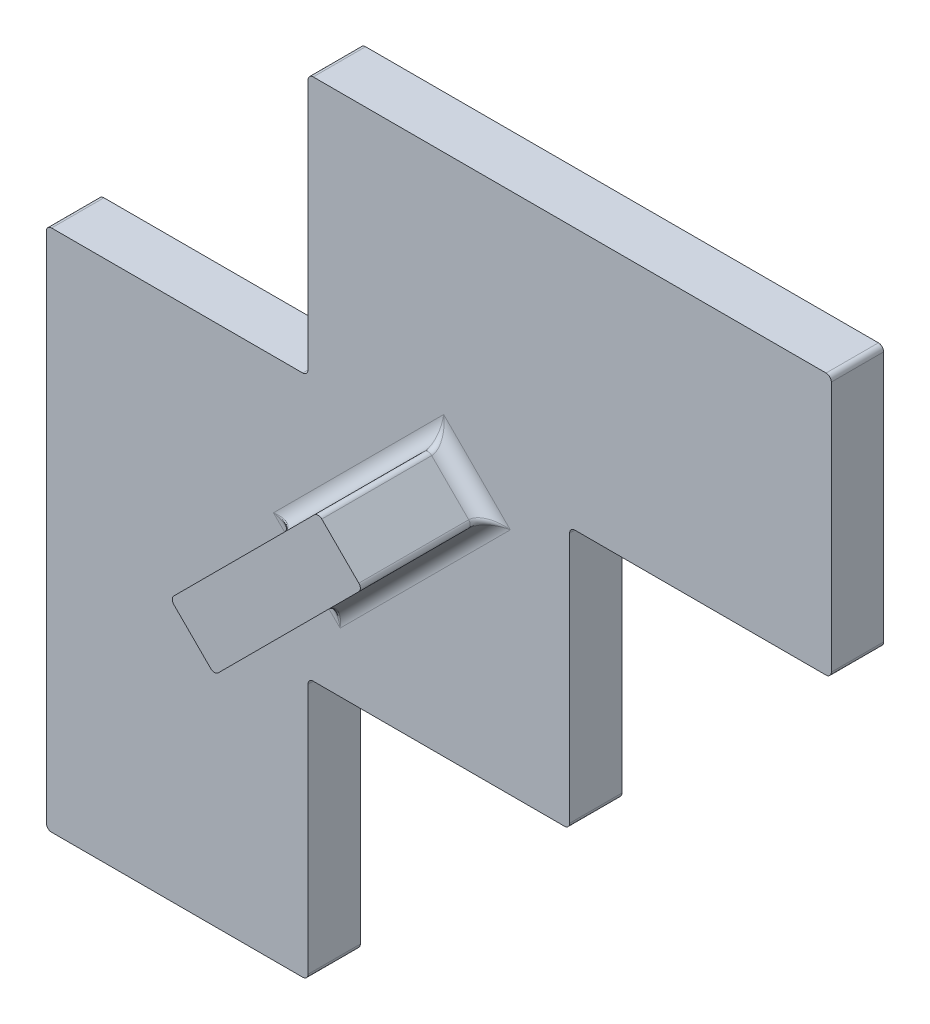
ISO-10303-21;
HEADER;
FILE_DESCRIPTION(('STEP AP214'),'2;1');
FILE_NAME('part.step','',(''),(''),'','','');
FILE_SCHEMA(('AUTOMOTIVE_DESIGN { 1 0 10303 214 1 1 1 1 }'));
ENDSEC;
DATA;
#1=APPLICATION_CONTEXT('core data for automotive mechanical design processes');
#2=APPLICATION_PROTOCOL_DEFINITION('international standard','automotive_design',2000,#1);
#3=PRODUCT_CONTEXT('',#1,'mechanical');
#4=PRODUCT('Part','Part','',(#3));
#5=PRODUCT_RELATED_PRODUCT_CATEGORY('part','',(#4));
#6=PRODUCT_DEFINITION_FORMATION('','',#4);
#7=PRODUCT_DEFINITION_CONTEXT('part definition',#1,'design');
#8=PRODUCT_DEFINITION('design','',#6,#7);
#9=PRODUCT_DEFINITION_SHAPE('','',#8);
#10=(LENGTH_UNIT() NAMED_UNIT(*) SI_UNIT(.MILLI.,.METRE.));
#11=(NAMED_UNIT(*) PLANE_ANGLE_UNIT() SI_UNIT($,.RADIAN.));
#12=(NAMED_UNIT(*) SI_UNIT($,.STERADIAN.) SOLID_ANGLE_UNIT());
#13=UNCERTAINTY_MEASURE_WITH_UNIT(LENGTH_MEASURE(1.E-05),#10,'distance_accuracy_value','');
#14=(GEOMETRIC_REPRESENTATION_CONTEXT(3) GLOBAL_UNCERTAINTY_ASSIGNED_CONTEXT((#13)) GLOBAL_UNIT_ASSIGNED_CONTEXT((#10,
#11,#12)) REPRESENTATION_CONTEXT('',''));
#15=CARTESIAN_POINT('',(0.,0.,0.));
#16=DIRECTION('',(0.,0.,1.));
#17=DIRECTION('',(1.,0.,0.));
#18=AXIS2_PLACEMENT_3D('',#15,#16,#17);
#19=CARTESIAN_POINT('',(0.,0.,5.));
#20=DIRECTION('',(0.,0.,1.));
#21=DIRECTION('',(1.,0.,0.));
#22=AXIS2_PLACEMENT_3D('',#19,#20,#21);
#23=PLANE('',#22);
#24=DIRECTION('',(-0.707106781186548,-0.707106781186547,0.));
#25=VECTOR('',#24,1.);
#26=CARTESIAN_POINT('',(-7.66765957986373,7.66765957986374,5.));
#27=LINE('',#26,#25);
#28=CARTESIAN_POINT('',(21.7006124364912,37.0359315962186,5.));
#29=VERTEX_POINT('',#28);
#30=CARTESIAN_POINT('',(37.9640684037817,53.2993875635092,5.));
#31=VERTEX_POINT('',#30);
#32=EDGE_CURVE('E420',#29,#31,#27,.F.);
#33=ORIENTED_EDGE('',*,*,#32,.T.);
#34=DIRECTION('',(-0.707106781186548,0.707106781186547,0.));
#35=VECTOR('',#34,1.);
#36=CARTESIAN_POINT('',(45.6317279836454,45.6317279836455,5.));
#37=LINE('',#36,#35);
#38=CARTESIAN_POINT('',(44.3280294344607,46.9354265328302,5.));
#39=VERTEX_POINT('',#38);
#40=EDGE_CURVE('E424',#31,#39,#37,.F.);
#41=ORIENTED_EDGE('',*,*,#40,.T.);
#42=DIRECTION('',(0.707106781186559,0.707106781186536,0.));
#43=VECTOR('',#42,1.);
#44=CARTESIAN_POINT('',(-1.30369854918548,1.30369854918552,5.));
#45=LINE('',#44,#43);
#46=CARTESIAN_POINT('',(28.0645734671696,30.6719705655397,5.));
#47=VERTEX_POINT('',#46);
#48=EDGE_CURVE('E412',#39,#47,#45,.F.);
#49=ORIENTED_EDGE('',*,*,#48,.T.);
#50=DIRECTION('',(0.707106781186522,-0.707106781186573,0.));
#51=VECTOR('',#50,1.);
#52=CARTESIAN_POINT('',(29.3682720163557,29.3682720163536,5.));
#53=LINE('',#52,#51);
#54=EDGE_CURVE('E416',#47,#29,#53,.F.);
#55=ORIENTED_EDGE('',*,*,#54,.T.);
#56=EDGE_LOOP('',(#33,#41,#49,#55));
#57=FACE_BOUND('',#56,.T.);
#58=DIRECTION('',(1.,0.,0.));
#59=VECTOR('',#58,1.);
#60=CARTESIAN_POINT('',(25.,75.,5.));
#61=LINE('',#60,#59);
#62=CARTESIAN_POINT('',(25.5,75.,5.));
#63=VERTEX_POINT('',#62);
#64=CARTESIAN_POINT('',(74.5,75.,5.));
#65=VERTEX_POINT('',#64);
#66=EDGE_CURVE('E635',#63,#65,#61,.T.);
#67=ORIENTED_EDGE('',*,*,#66,.F.);
#68=CARTESIAN_POINT('',(25.5,74.5,5.));
#69=DIRECTION('',(0.,0.,1.));
#70=DIRECTION('',(1.,0.,0.));
#71=AXIS2_PLACEMENT_3D('',#68,#69,#70);
#72=CIRCLE('',#71,0.5);
#73=CARTESIAN_POINT('',(25.,74.5,5.));
#74=VERTEX_POINT('',#73);
#75=EDGE_CURVE('E337',#63,#74,#72,.T.);
#76=ORIENTED_EDGE('',*,*,#75,.T.);
#77=DIRECTION('',(0.,1.,0.));
#78=VECTOR('',#77,1.);
#79=CARTESIAN_POINT('',(25.,50.,5.));
#80=LINE('',#79,#78);
#81=CARTESIAN_POINT('',(25.,50.5,5.));
#82=VERTEX_POINT('',#81);
#83=EDGE_CURVE('E632',#82,#74,#80,.T.);
#84=ORIENTED_EDGE('',*,*,#83,.F.);
#85=CARTESIAN_POINT('',(24.5,50.5,5.));
#86=DIRECTION('',(0.,0.,1.));
#87=DIRECTION('',(1.,0.,0.));
#88=AXIS2_PLACEMENT_3D('',#85,#86,#87);
#89=CIRCLE('',#88,0.5);
#90=CARTESIAN_POINT('',(24.5,50.,5.));
#91=VERTEX_POINT('',#90);
#92=EDGE_CURVE('E262',#82,#91,#89,.F.);
#93=ORIENTED_EDGE('',*,*,#92,.T.);
#94=DIRECTION('',(1.,0.,0.));
#95=VECTOR('',#94,1.);
#96=CARTESIAN_POINT('',(0.,50.,5.));
#97=LINE('',#96,#95);
#98=CARTESIAN_POINT('',(0.5,50.,5.));
#99=VERTEX_POINT('',#98);
#100=EDGE_CURVE('E628',#99,#91,#97,.T.);
#101=ORIENTED_EDGE('',*,*,#100,.F.);
#102=CARTESIAN_POINT('',(0.5,49.5,5.));
#103=DIRECTION('',(0.,0.,1.));
#104=DIRECTION('',(1.,0.,0.));
#105=AXIS2_PLACEMENT_3D('',#102,#103,#104);
#106=CIRCLE('',#105,0.5);
#107=CARTESIAN_POINT('',(0.,49.5,5.));
#108=VERTEX_POINT('',#107);
#109=EDGE_CURVE('E334',#99,#108,#106,.T.);
#110=ORIENTED_EDGE('',*,*,#109,.T.);
#111=DIRECTION('',(0.,1.,0.));
#112=VECTOR('',#111,1.);
#113=CARTESIAN_POINT('',(0.,0.,5.));
#114=LINE('',#113,#112);
#115=CARTESIAN_POINT('',(0.,0.5,5.));
#116=VERTEX_POINT('',#115);
#117=EDGE_CURVE('E279',#116,#108,#114,.T.);
#118=ORIENTED_EDGE('',*,*,#117,.F.);
#119=CARTESIAN_POINT('',(0.5,0.5,5.));
#120=DIRECTION('',(0.,0.,1.));
#121=DIRECTION('',(1.,0.,0.));
#122=AXIS2_PLACEMENT_3D('',#119,#120,#121);
#123=CIRCLE('',#122,0.5);
#124=CARTESIAN_POINT('',(0.5,0.,5.));
#125=VERTEX_POINT('',#124);
#126=EDGE_CURVE('E331',#116,#125,#123,.T.);
#127=ORIENTED_EDGE('',*,*,#126,.T.);
#128=DIRECTION('',(-1.,0.,0.));
#129=VECTOR('',#128,1.);
#130=CARTESIAN_POINT('',(25.,0.,5.));
#131=LINE('',#130,#129);
#132=CARTESIAN_POINT('',(24.5,0.,5.));
#133=VERTEX_POINT('',#132);
#134=EDGE_CURVE('E286',#133,#125,#131,.T.);
#135=ORIENTED_EDGE('',*,*,#134,.F.);
#136=CARTESIAN_POINT('',(24.5,0.5,5.));
#137=DIRECTION('',(0.,0.,1.));
#138=DIRECTION('',(1.,0.,0.));
#139=AXIS2_PLACEMENT_3D('',#136,#137,#138);
#140=CIRCLE('',#139,0.5);
#141=CARTESIAN_POINT('',(25.,0.5,5.));
#142=VERTEX_POINT('',#141);
#143=EDGE_CURVE('E319',#133,#142,#140,.T.);
#144=ORIENTED_EDGE('',*,*,#143,.T.);
#145=DIRECTION('',(0.,-1.,0.));
#146=VECTOR('',#145,1.);
#147=CARTESIAN_POINT('',(25.,25.,5.));
#148=LINE('',#147,#146);
#149=CARTESIAN_POINT('',(25.,24.5,5.));
#150=VERTEX_POINT('',#149);
#151=EDGE_CURVE('E655',#150,#142,#148,.T.);
#152=ORIENTED_EDGE('',*,*,#151,.F.);
#153=CARTESIAN_POINT('',(25.5,24.5,5.));
#154=DIRECTION('',(0.,0.,1.));
#155=DIRECTION('',(1.,0.,0.));
#156=AXIS2_PLACEMENT_3D('',#153,#154,#155);
#157=CIRCLE('',#156,0.5);
#158=CARTESIAN_POINT('',(25.5,25.,5.));
#159=VERTEX_POINT('',#158);
#160=EDGE_CURVE('E405',#150,#159,#157,.F.);
#161=ORIENTED_EDGE('',*,*,#160,.T.);
#162=DIRECTION('',(-1.,0.,0.));
#163=VECTOR('',#162,1.);
#164=CARTESIAN_POINT('',(50.,25.,5.));
#165=LINE('',#164,#163);
#166=CARTESIAN_POINT('',(49.5,25.,5.));
#167=VERTEX_POINT('',#166);
#168=EDGE_CURVE('E651',#167,#159,#165,.T.);
#169=ORIENTED_EDGE('',*,*,#168,.F.);
#170=CARTESIAN_POINT('',(49.5,25.5,5.));
#171=DIRECTION('',(0.,0.,1.));
#172=DIRECTION('',(1.,0.,0.));
#173=AXIS2_PLACEMENT_3D('',#170,#171,#172);
#174=CIRCLE('',#173,0.5);
#175=CARTESIAN_POINT('',(50.,25.5,5.));
#176=VERTEX_POINT('',#175);
#177=EDGE_CURVE('E322',#167,#176,#174,.T.);
#178=ORIENTED_EDGE('',*,*,#177,.T.);
#179=DIRECTION('',(0.,-1.,0.));
#180=VECTOR('',#179,1.);
#181=CARTESIAN_POINT('',(50.,50.,5.));
#182=LINE('',#181,#180);
#183=CARTESIAN_POINT('',(50.,49.5,5.));
#184=VERTEX_POINT('',#183);
#185=EDGE_CURVE('E647',#184,#176,#182,.T.);
#186=ORIENTED_EDGE('',*,*,#185,.F.);
#187=CARTESIAN_POINT('',(50.5,49.5,5.));
#188=DIRECTION('',(0.,0.,1.));
#189=DIRECTION('',(1.,0.,0.));
#190=AXIS2_PLACEMENT_3D('',#187,#188,#189);
#191=CIRCLE('',#190,0.5);
#192=CARTESIAN_POINT('',(50.5,50.,5.));
#193=VERTEX_POINT('',#192);
#194=EDGE_CURVE('E399',#184,#193,#191,.F.);
#195=ORIENTED_EDGE('',*,*,#194,.T.);
#196=DIRECTION('',(-1.,0.,0.));
#197=VECTOR('',#196,1.);
#198=CARTESIAN_POINT('',(75.,50.,5.));
#199=LINE('',#198,#197);
#200=CARTESIAN_POINT('',(74.5,50.,5.));
#201=VERTEX_POINT('',#200);
#202=EDGE_CURVE('E643',#201,#193,#199,.T.);
#203=ORIENTED_EDGE('',*,*,#202,.F.);
#204=CARTESIAN_POINT('',(74.5,50.5,5.));
#205=DIRECTION('',(0.,0.,1.));
#206=DIRECTION('',(1.,0.,0.));
#207=AXIS2_PLACEMENT_3D('',#204,#205,#206);
#208=CIRCLE('',#207,0.5);
#209=CARTESIAN_POINT('',(75.,50.5,5.));
#210=VERTEX_POINT('',#209);
#211=EDGE_CURVE('E325',#201,#210,#208,.T.);
#212=ORIENTED_EDGE('',*,*,#211,.T.);
#213=DIRECTION('',(0.,-1.,0.));
#214=VECTOR('',#213,1.);
#215=CARTESIAN_POINT('',(75.,75.,5.));
#216=LINE('',#215,#214);
#217=CARTESIAN_POINT('',(75.,74.5,5.));
#218=VERTEX_POINT('',#217);
#219=EDGE_CURVE('E639',#218,#210,#216,.T.);
#220=ORIENTED_EDGE('',*,*,#219,.F.);
#221=CARTESIAN_POINT('',(74.5,74.5,5.));
#222=DIRECTION('',(0.,0.,1.));
#223=DIRECTION('',(1.,0.,0.));
#224=AXIS2_PLACEMENT_3D('',#221,#222,#223);
#225=CIRCLE('',#224,0.5);
#226=EDGE_CURVE('E328',#218,#65,#225,.T.);
#227=ORIENTED_EDGE('',*,*,#226,.T.);
#228=EDGE_LOOP('',(#67,#76,#84,#93,#101,#110,#118,#127,#135,#144,#152,#161,#169,#178,#186,#195,
#203,#212,#220,#227));
#229=FACE_BOUND('',#228,.T.);
#230=ADVANCED_FACE('F50',(#57,#229),#23,.T.);
#231=CARTESIAN_POINT('',(0.,50.,5.));
#232=DIRECTION('',(0.,1.,0.));
#233=DIRECTION('',(0.,0.,1.));
#234=AXIS2_PLACEMENT_3D('',#231,#232,#233);
#235=PLANE('',#234);
#236=ORIENTED_EDGE('',*,*,#100,.T.);
#237=DIRECTION('',(0.,0.,-1.));
#238=VECTOR('',#237,1.);
#239=CARTESIAN_POINT('',(24.5,50.,0.));
#240=LINE('',#239,#238);
#241=CARTESIAN_POINT('',(24.5,50.,0.));
#242=VERTEX_POINT('',#241);
#243=EDGE_CURVE('E343',#91,#242,#240,.T.);
#244=ORIENTED_EDGE('',*,*,#243,.T.);
#245=DIRECTION('',(1.,0.,0.));
#246=VECTOR('',#245,1.);
#247=CARTESIAN_POINT('',(0.,50.,0.));
#248=LINE('',#247,#246);
#249=CARTESIAN_POINT('',(0.5,50.,0.));
#250=VERTEX_POINT('',#249);
#251=EDGE_CURVE('E256',#250,#242,#248,.T.);
#252=ORIENTED_EDGE('',*,*,#251,.F.);
#253=DIRECTION('',(0.,0.,-1.));
#254=VECTOR('',#253,1.);
#255=CARTESIAN_POINT('',(0.5,50.,5.));
#256=LINE('',#255,#254);
#257=EDGE_CURVE('E340',#250,#99,#256,.F.);
#258=ORIENTED_EDGE('',*,*,#257,.T.);
#259=EDGE_LOOP('',(#236,#244,#252,#258));
#260=FACE_BOUND('',#259,.T.);
#261=ADVANCED_FACE('F766',(#260),#235,.T.);
#262=CARTESIAN_POINT('',(0.,0.,5.));
#263=DIRECTION('',(-1.,0.,0.));
#264=DIRECTION('',(0.,0.,1.));
#265=AXIS2_PLACEMENT_3D('',#262,#263,#264);
#266=PLANE('',#265);
#267=ORIENTED_EDGE('',*,*,#117,.T.);
#268=DIRECTION('',(0.,0.,-1.));
#269=VECTOR('',#268,1.);
#270=CARTESIAN_POINT('',(0.,49.5,5.));
#271=LINE('',#270,#269);
#272=CARTESIAN_POINT('',(0.,49.5,0.));
#273=VERTEX_POINT('',#272);
#274=EDGE_CURVE('E349',#108,#273,#271,.T.);
#275=ORIENTED_EDGE('',*,*,#274,.T.);
#276=DIRECTION('',(0.,1.,0.));
#277=VECTOR('',#276,1.);
#278=CARTESIAN_POINT('',(0.,0.,0.));
#279=LINE('',#278,#277);
#280=CARTESIAN_POINT('',(0.,0.5,0.));
#281=VERTEX_POINT('',#280);
#282=EDGE_CURVE('E289',#281,#273,#279,.T.);
#283=ORIENTED_EDGE('',*,*,#282,.F.);
#284=DIRECTION('',(0.,0.,-1.));
#285=VECTOR('',#284,1.);
#286=CARTESIAN_POINT('',(0.,0.5,5.));
#287=LINE('',#286,#285);
#288=EDGE_CURVE('E346',#281,#116,#287,.F.);
#289=ORIENTED_EDGE('',*,*,#288,.T.);
#290=EDGE_LOOP('',(#267,#275,#283,#289));
#291=FACE_BOUND('',#290,.T.);
#292=ADVANCED_FACE('F695',(#291),#266,.T.);
#293=CARTESIAN_POINT('',(25.,0.,5.));
#294=DIRECTION('',(0.,-1.,0.));
#295=DIRECTION('',(1.,0.,0.));
#296=AXIS2_PLACEMENT_3D('',#293,#294,#295);
#297=PLANE('',#296);
#298=ORIENTED_EDGE('',*,*,#134,.T.);
#299=DIRECTION('',(0.,0.,-1.));
#300=VECTOR('',#299,1.);
#301=CARTESIAN_POINT('',(0.5,0.,5.));
#302=LINE('',#301,#300);
#303=CARTESIAN_POINT('',(0.5,0.,0.));
#304=VERTEX_POINT('',#303);
#305=EDGE_CURVE('E356',#125,#304,#302,.T.);
#306=ORIENTED_EDGE('',*,*,#305,.T.);
#307=DIRECTION('',(-1.,0.,0.));
#308=VECTOR('',#307,1.);
#309=CARTESIAN_POINT('',(25.,0.,0.));
#310=LINE('',#309,#308);
#311=CARTESIAN_POINT('',(24.5,0.,0.));
#312=VERTEX_POINT('',#311);
#313=EDGE_CURVE('E686',#312,#304,#310,.T.);
#314=ORIENTED_EDGE('',*,*,#313,.F.);
#315=DIRECTION('',(0.,0.,-1.));
#316=VECTOR('',#315,1.);
#317=CARTESIAN_POINT('',(24.5,0.,5.));
#318=LINE('',#317,#316);
#319=EDGE_CURVE('E353',#312,#133,#318,.F.);
#320=ORIENTED_EDGE('',*,*,#319,.T.);
#321=EDGE_LOOP('',(#298,#306,#314,#320));
#322=FACE_BOUND('',#321,.T.);
#323=ADVANCED_FACE('F706',(#322),#297,.T.);
#324=CARTESIAN_POINT('',(25.,25.,5.));
#325=DIRECTION('',(1.,0.,0.));
#326=DIRECTION('',(0.,0.,-1.));
#327=AXIS2_PLACEMENT_3D('',#324,#325,#326);
#328=PLANE('',#327);
#329=DIRECTION('',(0.,-1.,0.));
#330=VECTOR('',#329,1.);
#331=CARTESIAN_POINT('',(25.,25.,0.));
#332=LINE('',#331,#330);
#333=CARTESIAN_POINT('',(25.,24.5,0.));
#334=VERTEX_POINT('',#333);
#335=CARTESIAN_POINT('',(25.,0.5,0.));
#336=VERTEX_POINT('',#335);
#337=EDGE_CURVE('E683',#334,#336,#332,.T.);
#338=ORIENTED_EDGE('',*,*,#337,.F.);
#339=DIRECTION('',(0.,0.,-1.));
#340=VECTOR('',#339,1.);
#341=CARTESIAN_POINT('',(25.,24.5,5.));
#342=LINE('',#341,#340);
#343=EDGE_CURVE('E263',#334,#150,#342,.F.);
#344=ORIENTED_EDGE('',*,*,#343,.T.);
#345=ORIENTED_EDGE('',*,*,#151,.T.);
#346=DIRECTION('',(0.,0.,-1.));
#347=VECTOR('',#346,1.);
#348=CARTESIAN_POINT('',(25.,0.5,5.));
#349=LINE('',#348,#347);
#350=EDGE_CURVE('E388',#142,#336,#349,.T.);
#351=ORIENTED_EDGE('',*,*,#350,.T.);
#352=EDGE_LOOP('',(#338,#344,#345,#351));
#353=FACE_BOUND('',#352,.T.);
#354=ADVANCED_FACE('F715',(#353),#328,.T.);
#355=CARTESIAN_POINT('',(50.,25.,5.));
#356=DIRECTION('',(0.,-1.,0.));
#357=DIRECTION('',(1.,0.,0.));
#358=AXIS2_PLACEMENT_3D('',#355,#356,#357);
#359=PLANE('',#358);
#360=DIRECTION('',(-1.,0.,0.));
#361=VECTOR('',#360,1.);
#362=CARTESIAN_POINT('',(50.,25.,0.));
#363=LINE('',#362,#361);
#364=CARTESIAN_POINT('',(49.5,25.,0.));
#365=VERTEX_POINT('',#364);
#366=CARTESIAN_POINT('',(25.5,25.,0.));
#367=VERTEX_POINT('',#366);
#368=EDGE_CURVE('E679',#365,#367,#363,.T.);
#369=ORIENTED_EDGE('',*,*,#368,.F.);
#370=DIRECTION('',(0.,0.,-1.));
#371=VECTOR('',#370,1.);
#372=CARTESIAN_POINT('',(49.5,25.,5.));
#373=LINE('',#372,#371);
#374=EDGE_CURVE('E385',#365,#167,#373,.F.);
#375=ORIENTED_EDGE('',*,*,#374,.T.);
#376=ORIENTED_EDGE('',*,*,#168,.T.);
#377=DIRECTION('',(0.,0.,-1.));
#378=VECTOR('',#377,1.);
#379=CARTESIAN_POINT('',(25.5,25.,0.));
#380=LINE('',#379,#378);
#381=EDGE_CURVE('E381',#159,#367,#380,.T.);
#382=ORIENTED_EDGE('',*,*,#381,.T.);
#383=EDGE_LOOP('',(#369,#375,#376,#382));
#384=FACE_BOUND('',#383,.T.);
#385=ADVANCED_FACE('F724',(#384),#359,.T.);
#386=CARTESIAN_POINT('',(50.,50.,5.));
#387=DIRECTION('',(1.,0.,0.));
#388=DIRECTION('',(0.,1.,0.));
#389=AXIS2_PLACEMENT_3D('',#386,#387,#388);
#390=PLANE('',#389);
#391=DIRECTION('',(0.,-1.,0.));
#392=VECTOR('',#391,1.);
#393=CARTESIAN_POINT('',(50.,50.,0.));
#394=LINE('',#393,#392);
#395=CARTESIAN_POINT('',(50.,49.5,0.));
#396=VERTEX_POINT('',#395);
#397=CARTESIAN_POINT('',(50.,25.5,0.));
#398=VERTEX_POINT('',#397);
#399=EDGE_CURVE('E675',#396,#398,#394,.T.);
#400=ORIENTED_EDGE('',*,*,#399,.F.);
#401=DIRECTION('',(0.,0.,-1.));
#402=VECTOR('',#401,1.);
#403=CARTESIAN_POINT('',(50.,49.5,5.));
#404=LINE('',#403,#402);
#405=EDGE_CURVE('E378',#396,#184,#404,.F.);
#406=ORIENTED_EDGE('',*,*,#405,.T.);
#407=ORIENTED_EDGE('',*,*,#185,.T.);
#408=DIRECTION('',(0.,0.,-1.));
#409=VECTOR('',#408,1.);
#410=CARTESIAN_POINT('',(50.,25.5,5.));
#411=LINE('',#410,#409);
#412=EDGE_CURVE('E374',#176,#398,#411,.T.);
#413=ORIENTED_EDGE('',*,*,#412,.T.);
#414=EDGE_LOOP('',(#400,#406,#407,#413));
#415=FACE_BOUND('',#414,.T.);
#416=ADVANCED_FACE('F733',(#415),#390,.T.);
#417=CARTESIAN_POINT('',(75.,50.,5.));
#418=DIRECTION('',(0.,-1.,0.));
#419=DIRECTION('',(1.,0.,0.));
#420=AXIS2_PLACEMENT_3D('',#417,#418,#419);
#421=PLANE('',#420);
#422=DIRECTION('',(-1.,0.,0.));
#423=VECTOR('',#422,1.);
#424=CARTESIAN_POINT('',(75.,50.,0.));
#425=LINE('',#424,#423);
#426=CARTESIAN_POINT('',(74.5,50.,0.));
#427=VERTEX_POINT('',#426);
#428=CARTESIAN_POINT('',(50.5,50.,0.));
#429=VERTEX_POINT('',#428);
#430=EDGE_CURVE('E671',#427,#429,#425,.T.);
#431=ORIENTED_EDGE('',*,*,#430,.F.);
#432=DIRECTION('',(0.,0.,-1.));
#433=VECTOR('',#432,1.);
#434=CARTESIAN_POINT('',(74.5,50.,5.));
#435=LINE('',#434,#433);
#436=EDGE_CURVE('E371',#427,#201,#435,.F.);
#437=ORIENTED_EDGE('',*,*,#436,.T.);
#438=ORIENTED_EDGE('',*,*,#202,.T.);
#439=DIRECTION('',(0.,0.,-1.));
#440=VECTOR('',#439,1.);
#441=CARTESIAN_POINT('',(50.5,50.,0.));
#442=LINE('',#441,#440);
#443=EDGE_CURVE('E367',#193,#429,#442,.T.);
#444=ORIENTED_EDGE('',*,*,#443,.T.);
#445=EDGE_LOOP('',(#431,#437,#438,#444));
#446=FACE_BOUND('',#445,.T.);
#447=ADVANCED_FACE('F742',(#446),#421,.T.);
#448=CARTESIAN_POINT('',(75.,75.,5.));
#449=DIRECTION('',(1.,0.,0.));
#450=DIRECTION('',(0.,0.,-1.));
#451=AXIS2_PLACEMENT_3D('',#448,#449,#450);
#452=PLANE('',#451);
#453=DIRECTION('',(0.,-1.,0.));
#454=VECTOR('',#453,1.);
#455=CARTESIAN_POINT('',(75.,75.,0.));
#456=LINE('',#455,#454);
#457=CARTESIAN_POINT('',(75.,74.5,0.));
#458=VERTEX_POINT('',#457);
#459=CARTESIAN_POINT('',(75.,50.5,0.));
#460=VERTEX_POINT('',#459);
#461=EDGE_CURVE('E667',#458,#460,#456,.T.);
#462=ORIENTED_EDGE('',*,*,#461,.F.);
#463=DIRECTION('',(0.,0.,-1.));
#464=VECTOR('',#463,1.);
#465=CARTESIAN_POINT('',(75.,74.5,5.));
#466=LINE('',#465,#464);
#467=EDGE_CURVE('E364',#458,#218,#466,.F.);
#468=ORIENTED_EDGE('',*,*,#467,.T.);
#469=ORIENTED_EDGE('',*,*,#219,.T.);
#470=DIRECTION('',(0.,0.,-1.));
#471=VECTOR('',#470,1.);
#472=CARTESIAN_POINT('',(75.,50.5,5.));
#473=LINE('',#472,#471);
#474=EDGE_CURVE('E360',#210,#460,#473,.T.);
#475=ORIENTED_EDGE('',*,*,#474,.T.);
#476=EDGE_LOOP('',(#462,#468,#469,#475));
#477=FACE_BOUND('',#476,.T.);
#478=ADVANCED_FACE('F751',(#477),#452,.T.);
#479=CARTESIAN_POINT('',(25.,75.,5.));
#480=DIRECTION('',(0.,1.,0.));
#481=DIRECTION('',(0.,0.,1.));
#482=AXIS2_PLACEMENT_3D('',#479,#480,#481);
#483=PLANE('',#482);
#484=DIRECTION('',(1.,0.,0.));
#485=VECTOR('',#484,1.);
#486=CARTESIAN_POINT('',(25.,75.,0.));
#487=LINE('',#486,#485);
#488=CARTESIAN_POINT('',(25.5,75.,0.));
#489=VERTEX_POINT('',#488);
#490=CARTESIAN_POINT('',(74.5,75.,0.));
#491=VERTEX_POINT('',#490);
#492=EDGE_CURVE('E274',#489,#491,#487,.T.);
#493=ORIENTED_EDGE('',*,*,#492,.F.);
#494=DIRECTION('',(0.,0.,-1.));
#495=VECTOR('',#494,1.);
#496=CARTESIAN_POINT('',(25.5,75.,5.));
#497=LINE('',#496,#495);
#498=EDGE_CURVE('E316',#489,#63,#497,.F.);
#499=ORIENTED_EDGE('',*,*,#498,.T.);
#500=ORIENTED_EDGE('',*,*,#66,.T.);
#501=DIRECTION('',(0.,0.,-1.));
#502=VECTOR('',#501,1.);
#503=CARTESIAN_POINT('',(74.5,75.,5.));
#504=LINE('',#503,#502);
#505=EDGE_CURVE('E312',#65,#491,#504,.T.);
#506=ORIENTED_EDGE('',*,*,#505,.T.);
#507=EDGE_LOOP('',(#493,#499,#500,#506));
#508=FACE_BOUND('',#507,.T.);
#509=ADVANCED_FACE('F759',(#508),#483,.T.);
#510=CARTESIAN_POINT('',(25.,50.,5.));
#511=DIRECTION('',(-1.,0.,0.));
#512=DIRECTION('',(0.,0.,1.));
#513=AXIS2_PLACEMENT_3D('',#510,#511,#512);
#514=PLANE('',#513);
#515=ORIENTED_EDGE('',*,*,#83,.T.);
#516=DIRECTION('',(0.,0.,-1.));
#517=VECTOR('',#516,1.);
#518=CARTESIAN_POINT('',(25.,74.5,5.));
#519=LINE('',#518,#517);
#520=CARTESIAN_POINT('',(25.,74.5,0.));
#521=VERTEX_POINT('',#520);
#522=EDGE_CURVE('E272',#74,#521,#519,.T.);
#523=ORIENTED_EDGE('',*,*,#522,.T.);
#524=DIRECTION('',(0.,1.,0.));
#525=VECTOR('',#524,1.);
#526=CARTESIAN_POINT('',(25.,50.,0.));
#527=LINE('',#526,#525);
#528=CARTESIAN_POINT('',(25.,50.5,0.));
#529=VERTEX_POINT('',#528);
#530=EDGE_CURVE('E254',#529,#521,#527,.T.);
#531=ORIENTED_EDGE('',*,*,#530,.F.);
#532=DIRECTION('',(0.,0.,-1.));
#533=VECTOR('',#532,1.);
#534=CARTESIAN_POINT('',(25.,50.5,5.));
#535=LINE('',#534,#533);
#536=EDGE_CURVE('E269',#529,#82,#535,.F.);
#537=ORIENTED_EDGE('',*,*,#536,.T.);
#538=EDGE_LOOP('',(#515,#523,#531,#537));
#539=FACE_BOUND('',#538,.T.);
#540=ADVANCED_FACE('F268',(#539),#514,.T.);
#541=CARTESIAN_POINT('',(0.,0.,0.));
#542=DIRECTION('',(0.,0.,1.));
#543=DIRECTION('',(1.,0.,0.));
#544=AXIS2_PLACEMENT_3D('',#541,#542,#543);
#545=PLANE('',#544);
#546=ORIENTED_EDGE('',*,*,#530,.T.);
#547=CARTESIAN_POINT('',(25.5,74.5,0.));
#548=DIRECTION('',(0.,0.,1.));
#549=DIRECTION('',(1.,0.,0.));
#550=AXIS2_PLACEMENT_3D('',#547,#548,#549);
#551=CIRCLE('',#550,0.5);
#552=EDGE_CURVE('E309',#521,#489,#551,.F.);
#553=ORIENTED_EDGE('',*,*,#552,.T.);
#554=ORIENTED_EDGE('',*,*,#492,.T.);
#555=CARTESIAN_POINT('',(74.5,74.5,0.));
#556=DIRECTION('',(0.,0.,1.));
#557=DIRECTION('',(1.,0.,0.));
#558=AXIS2_PLACEMENT_3D('',#555,#556,#557);
#559=CIRCLE('',#558,0.5);
#560=EDGE_CURVE('E300',#491,#458,#559,.F.);
#561=ORIENTED_EDGE('',*,*,#560,.T.);
#562=ORIENTED_EDGE('',*,*,#461,.T.);
#563=CARTESIAN_POINT('',(74.5,50.5,0.));
#564=DIRECTION('',(0.,0.,1.));
#565=DIRECTION('',(1.,0.,0.));
#566=AXIS2_PLACEMENT_3D('',#563,#564,#565);
#567=CIRCLE('',#566,0.5);
#568=EDGE_CURVE('E297',#460,#427,#567,.F.);
#569=ORIENTED_EDGE('',*,*,#568,.T.);
#570=ORIENTED_EDGE('',*,*,#430,.T.);
#571=CARTESIAN_POINT('',(50.5,49.5,0.));
#572=DIRECTION('',(0.,0.,1.));
#573=DIRECTION('',(1.,0.,0.));
#574=AXIS2_PLACEMENT_3D('',#571,#572,#573);
#575=CIRCLE('',#574,0.5);
#576=EDGE_CURVE('E396',#429,#396,#575,.T.);
#577=ORIENTED_EDGE('',*,*,#576,.T.);
#578=ORIENTED_EDGE('',*,*,#399,.T.);
#579=CARTESIAN_POINT('',(49.5,25.5,0.));
#580=DIRECTION('',(0.,0.,1.));
#581=DIRECTION('',(1.,0.,0.));
#582=AXIS2_PLACEMENT_3D('',#579,#580,#581);
#583=CIRCLE('',#582,0.5);
#584=EDGE_CURVE('E294',#398,#365,#583,.F.);
#585=ORIENTED_EDGE('',*,*,#584,.T.);
#586=ORIENTED_EDGE('',*,*,#368,.T.);
#587=CARTESIAN_POINT('',(25.5,24.5,0.));
#588=DIRECTION('',(0.,0.,1.));
#589=DIRECTION('',(1.,0.,0.));
#590=AXIS2_PLACEMENT_3D('',#587,#588,#589);
#591=CIRCLE('',#590,0.5);
#592=EDGE_CURVE('E402',#367,#334,#591,.T.);
#593=ORIENTED_EDGE('',*,*,#592,.T.);
#594=ORIENTED_EDGE('',*,*,#337,.T.);
#595=CARTESIAN_POINT('',(24.5,0.5,0.));
#596=DIRECTION('',(0.,0.,1.));
#597=DIRECTION('',(1.,0.,0.));
#598=AXIS2_PLACEMENT_3D('',#595,#596,#597);
#599=CIRCLE('',#598,0.5);
#600=EDGE_CURVE('E283',#336,#312,#599,.F.);
#601=ORIENTED_EDGE('',*,*,#600,.T.);
#602=ORIENTED_EDGE('',*,*,#313,.T.);
#603=CARTESIAN_POINT('',(0.5,0.5,0.));
#604=DIRECTION('',(0.,0.,1.));
#605=DIRECTION('',(1.,0.,0.));
#606=AXIS2_PLACEMENT_3D('',#603,#604,#605);
#607=CIRCLE('',#606,0.5);
#608=EDGE_CURVE('E303',#304,#281,#607,.F.);
#609=ORIENTED_EDGE('',*,*,#608,.T.);
#610=ORIENTED_EDGE('',*,*,#282,.T.);
#611=CARTESIAN_POINT('',(0.5,49.5,0.));
#612=DIRECTION('',(0.,0.,1.));
#613=DIRECTION('',(1.,0.,0.));
#614=AXIS2_PLACEMENT_3D('',#611,#612,#613);
#615=CIRCLE('',#614,0.5);
#616=EDGE_CURVE('E306',#273,#250,#615,.F.);
#617=ORIENTED_EDGE('',*,*,#616,.T.);
#618=ORIENTED_EDGE('',*,*,#251,.T.);
#619=CARTESIAN_POINT('',(24.5,50.5,0.));
#620=DIRECTION('',(0.,0.,1.));
#621=DIRECTION('',(1.,0.,0.));
#622=AXIS2_PLACEMENT_3D('',#619,#620,#621);
#623=CIRCLE('',#622,0.5);
#624=EDGE_CURVE('E251',#242,#529,#623,.T.);
#625=ORIENTED_EDGE('',*,*,#624,.T.);
#626=EDGE_LOOP('',(#546,#553,#554,#561,#562,#569,#570,#577,#578,#585,#586,#593,#594,#601,#602,
#609,#610,#617,#618,#625));
#627=FACE_BOUND('',#626,.T.);
#628=ADVANCED_FACE('F253',(#627),#545,.F.);
#629=CARTESIAN_POINT('',(25.5,74.5,5.));
#630=DIRECTION('',(0.,0.,-1.));
#631=DIRECTION('',(-1.,0.,0.));
#632=AXIS2_PLACEMENT_3D('',#629,#630,#631);
#633=CYLINDRICAL_SURFACE('',#632,0.5);
#634=ORIENTED_EDGE('',*,*,#75,.F.);
#635=ORIENTED_EDGE('',*,*,#498,.F.);
#636=ORIENTED_EDGE('',*,*,#552,.F.);
#637=ORIENTED_EDGE('',*,*,#522,.F.);
#638=EDGE_LOOP('',(#634,#635,#636,#637));
#639=FACE_BOUND('',#638,.T.);
#640=ADVANCED_FACE('F762',(#639),#633,.T.);
#641=CARTESIAN_POINT('',(24.5,50.5,5.));
#642=DIRECTION('',(0.,0.,1.));
#643=DIRECTION('',(1.,0.,0.));
#644=AXIS2_PLACEMENT_3D('',#641,#642,#643);
#645=CYLINDRICAL_SURFACE('',#644,0.5);
#646=ORIENTED_EDGE('',*,*,#92,.F.);
#647=ORIENTED_EDGE('',*,*,#536,.F.);
#648=ORIENTED_EDGE('',*,*,#624,.F.);
#649=ORIENTED_EDGE('',*,*,#243,.F.);
#650=EDGE_LOOP('',(#646,#647,#648,#649));
#651=FACE_BOUND('',#650,.T.);
#652=ADVANCED_FACE('F277',(#651),#645,.F.);
#653=CARTESIAN_POINT('',(0.5,49.5,5.));
#654=DIRECTION('',(0.,0.,-1.));
#655=DIRECTION('',(-1.,0.,0.));
#656=AXIS2_PLACEMENT_3D('',#653,#654,#655);
#657=CYLINDRICAL_SURFACE('',#656,0.5);
#658=ORIENTED_EDGE('',*,*,#109,.F.);
#659=ORIENTED_EDGE('',*,*,#257,.F.);
#660=ORIENTED_EDGE('',*,*,#616,.F.);
#661=ORIENTED_EDGE('',*,*,#274,.F.);
#662=EDGE_LOOP('',(#658,#659,#660,#661));
#663=FACE_BOUND('',#662,.T.);
#664=ADVANCED_FACE('F769',(#663),#657,.T.);
#665=CARTESIAN_POINT('',(0.5,0.5,5.));
#666=DIRECTION('',(0.,0.,-1.));
#667=DIRECTION('',(-1.,0.,0.));
#668=AXIS2_PLACEMENT_3D('',#665,#666,#667);
#669=CYLINDRICAL_SURFACE('',#668,0.5);
#670=ORIENTED_EDGE('',*,*,#126,.F.);
#671=ORIENTED_EDGE('',*,*,#288,.F.);
#672=ORIENTED_EDGE('',*,*,#608,.F.);
#673=ORIENTED_EDGE('',*,*,#305,.F.);
#674=EDGE_LOOP('',(#670,#671,#672,#673));
#675=FACE_BOUND('',#674,.T.);
#676=ADVANCED_FACE('F700',(#675),#669,.T.);
#677=CARTESIAN_POINT('',(74.5,74.5,5.));
#678=DIRECTION('',(0.,0.,-1.));
#679=DIRECTION('',(-1.,0.,0.));
#680=AXIS2_PLACEMENT_3D('',#677,#678,#679);
#681=CYLINDRICAL_SURFACE('',#680,0.5);
#682=ORIENTED_EDGE('',*,*,#226,.F.);
#683=ORIENTED_EDGE('',*,*,#467,.F.);
#684=ORIENTED_EDGE('',*,*,#560,.F.);
#685=ORIENTED_EDGE('',*,*,#505,.F.);
#686=EDGE_LOOP('',(#682,#683,#684,#685));
#687=FACE_BOUND('',#686,.T.);
#688=ADVANCED_FACE('F754',(#687),#681,.T.);
#689=CARTESIAN_POINT('',(74.5,50.5,5.));
#690=DIRECTION('',(0.,0.,-1.));
#691=DIRECTION('',(-1.,0.,0.));
#692=AXIS2_PLACEMENT_3D('',#689,#690,#691);
#693=CYLINDRICAL_SURFACE('',#692,0.5);
#694=ORIENTED_EDGE('',*,*,#211,.F.);
#695=ORIENTED_EDGE('',*,*,#436,.F.);
#696=ORIENTED_EDGE('',*,*,#568,.F.);
#697=ORIENTED_EDGE('',*,*,#474,.F.);
#698=EDGE_LOOP('',(#694,#695,#696,#697));
#699=FACE_BOUND('',#698,.T.);
#700=ADVANCED_FACE('F745',(#699),#693,.T.);
#701=CARTESIAN_POINT('',(50.5,49.5,5.));
#702=DIRECTION('',(0.,0.,1.));
#703=DIRECTION('',(1.,0.,0.));
#704=AXIS2_PLACEMENT_3D('',#701,#702,#703);
#705=CYLINDRICAL_SURFACE('',#704,0.5);
#706=ORIENTED_EDGE('',*,*,#194,.F.);
#707=ORIENTED_EDGE('',*,*,#405,.F.);
#708=ORIENTED_EDGE('',*,*,#576,.F.);
#709=ORIENTED_EDGE('',*,*,#443,.F.);
#710=EDGE_LOOP('',(#706,#707,#708,#709));
#711=FACE_BOUND('',#710,.T.);
#712=ADVANCED_FACE('F736',(#711),#705,.F.);
#713=CARTESIAN_POINT('',(49.5,25.5,5.));
#714=DIRECTION('',(0.,0.,-1.));
#715=DIRECTION('',(-1.,0.,0.));
#716=AXIS2_PLACEMENT_3D('',#713,#714,#715);
#717=CYLINDRICAL_SURFACE('',#716,0.5);
#718=ORIENTED_EDGE('',*,*,#177,.F.);
#719=ORIENTED_EDGE('',*,*,#374,.F.);
#720=ORIENTED_EDGE('',*,*,#584,.F.);
#721=ORIENTED_EDGE('',*,*,#412,.F.);
#722=EDGE_LOOP('',(#718,#719,#720,#721));
#723=FACE_BOUND('',#722,.T.);
#724=ADVANCED_FACE('F727',(#723),#717,.T.);
#725=CARTESIAN_POINT('',(25.5,24.5,5.));
#726=DIRECTION('',(0.,0.,1.));
#727=DIRECTION('',(1.,0.,0.));
#728=AXIS2_PLACEMENT_3D('',#725,#726,#727);
#729=CYLINDRICAL_SURFACE('',#728,0.5);
#730=ORIENTED_EDGE('',*,*,#160,.F.);
#731=ORIENTED_EDGE('',*,*,#343,.F.);
#732=ORIENTED_EDGE('',*,*,#592,.F.);
#733=ORIENTED_EDGE('',*,*,#381,.F.);
#734=EDGE_LOOP('',(#730,#731,#732,#733));
#735=FACE_BOUND('',#734,.T.);
#736=ADVANCED_FACE('F718',(#735),#729,.F.);
#737=CARTESIAN_POINT('',(24.5,0.5,5.));
#738=DIRECTION('',(0.,0.,-1.));
#739=DIRECTION('',(-1.,0.,0.));
#740=AXIS2_PLACEMENT_3D('',#737,#738,#739);
#741=CYLINDRICAL_SURFACE('',#740,0.5);
#742=ORIENTED_EDGE('',*,*,#143,.F.);
#743=ORIENTED_EDGE('',*,*,#319,.F.);
#744=ORIENTED_EDGE('',*,*,#600,.F.);
#745=ORIENTED_EDGE('',*,*,#350,.F.);
#746=EDGE_LOOP('',(#742,#743,#744,#745));
#747=FACE_BOUND('',#746,.T.);
#748=ADVANCED_FACE('F709',(#747),#741,.T.);
#749=CARTESIAN_POINT('',(42.206709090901,46.9354265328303,17.));
#750=DIRECTION('',(-0.707106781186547,-0.707106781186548,0.));
#751=DIRECTION('',(0.707106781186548,-0.707106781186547,0.));
#752=AXIS2_PLACEMENT_3D('',#749,#750,#751);
#753=PLANE('',#752);
#754=DIRECTION('',(-0.707106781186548,0.707106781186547,0.));
#755=VECTOR('',#754,1.);
#756=CARTESIAN_POINT('',(42.206709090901,46.9354265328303,17.));
#757=LINE('',#756,#755);
#758=CARTESIAN_POINT('',(41.8531557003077,47.2889799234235,17.));
#759=VERTEX_POINT('',#758);
#760=CARTESIAN_POINT('',(38.317621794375,50.8245138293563,17.));
#761=VERTEX_POINT('',#760);
#762=EDGE_CURVE('E501',#759,#761,#757,.T.);
#763=ORIENTED_EDGE('',*,*,#762,.F.);
#764=DIRECTION('',(0.,0.,-1.));
#765=VECTOR('',#764,1.);
#766=CARTESIAN_POINT('',(41.8531557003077,47.2889799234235,17.));
#767=LINE('',#766,#765);
#768=CARTESIAN_POINT('',(41.8531557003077,47.2889799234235,6.5));
#769=VERTEX_POINT('',#768);
#770=EDGE_CURVE('E11',#759,#769,#767,.T.);
#771=ORIENTED_EDGE('',*,*,#770,.T.);
#772=DIRECTION('',(-0.707106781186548,0.707106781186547,0.));
#773=VECTOR('',#772,1.);
#774=CARTESIAN_POINT('',(42.206709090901,46.9354265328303,6.5));
#775=LINE('',#774,#773);
#776=CARTESIAN_POINT('',(38.317621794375,50.8245138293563,6.5));
#777=VERTEX_POINT('',#776);
#778=EDGE_CURVE('E408',#769,#777,#775,.T.);
#779=ORIENTED_EDGE('',*,*,#778,.T.);
#780=DIRECTION('',(0.,0.,-1.));
#781=VECTOR('',#780,1.);
#782=CARTESIAN_POINT('',(38.317621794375,50.8245138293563,17.));
#783=LINE('',#782,#781);
#784=EDGE_CURVE('E60',#777,#761,#783,.F.);
#785=ORIENTED_EDGE('',*,*,#784,.T.);
#786=EDGE_LOOP('',(#763,#771,#779,#785));
#787=FACE_BOUND('',#786,.T.);
#788=ADVANCED_FACE('F577',(#787),#753,.F.);
#789=CARTESIAN_POINT('',(37.9640684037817,51.1780672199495,17.));
#790=DIRECTION('',(0.707106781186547,-0.707106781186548,0.));
#791=DIRECTION('',(0.707106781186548,0.707106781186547,0.));
#792=AXIS2_PLACEMENT_3D('',#789,#790,#791);
#793=PLANE('',#792);
#794=DIRECTION('',(-0.707106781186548,-0.707106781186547,0.));
#795=VECTOR('',#794,1.);
#796=CARTESIAN_POINT('',(37.9640684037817,51.1780672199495,6.5));
#797=LINE('',#796,#795);
#798=CARTESIAN_POINT('',(37.6105150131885,50.8245138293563,6.5));
#799=VERTEX_POINT('',#798);
#800=CARTESIAN_POINT('',(24.175486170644,37.3894849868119,6.5));
#801=VERTEX_POINT('',#800);
#802=EDGE_CURVE('E428',#799,#801,#797,.T.);
#803=ORIENTED_EDGE('',*,*,#802,.T.);
#804=DIRECTION('',(0.,0.,-1.));
#805=VECTOR('',#804,1.);
#806=CARTESIAN_POINT('',(24.175486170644,37.3894849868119,17.));
#807=LINE('',#806,#805);
#808=CARTESIAN_POINT('',(24.175486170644,37.3894849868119,17.));
#809=VERTEX_POINT('',#808);
#810=EDGE_CURVE('E68',#801,#809,#807,.F.);
#811=ORIENTED_EDGE('',*,*,#810,.T.);
#812=DIRECTION('',(-0.707106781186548,-0.707106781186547,0.));
#813=VECTOR('',#812,1.);
#814=CARTESIAN_POINT('',(37.9640684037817,51.1780672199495,17.));
#815=LINE('',#814,#813);
#816=CARTESIAN_POINT('',(37.6105150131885,50.8245138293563,17.));
#817=VERTEX_POINT('',#816);
#818=EDGE_CURVE('E570',#817,#809,#815,.T.);
#819=ORIENTED_EDGE('',*,*,#818,.F.);
#820=DIRECTION('',(0.,0.,-1.));
#821=VECTOR('',#820,1.);
#822=CARTESIAN_POINT('',(37.6105150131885,50.8245138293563,17.));
#823=LINE('',#822,#821);
#824=EDGE_CURVE('E490',#817,#799,#823,.T.);
#825=ORIENTED_EDGE('',*,*,#824,.T.);
#826=EDGE_LOOP('',(#803,#811,#819,#825));
#827=FACE_BOUND('',#826,.T.);
#828=ADVANCED_FACE('F568',(#827),#793,.F.);
#829=CARTESIAN_POINT('',(23.8219327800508,37.0359315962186,17.));
#830=DIRECTION('',(0.707106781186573,0.707106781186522,0.));
#831=DIRECTION('',(-0.707106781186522,0.707106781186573,0.));
#832=AXIS2_PLACEMENT_3D('',#829,#830,#831);
#833=PLANE('',#832);
#834=DIRECTION('',(0.707106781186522,-0.707106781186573,0.));
#835=VECTOR('',#834,1.);
#836=CARTESIAN_POINT('',(23.8219327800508,37.0359315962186,6.5));
#837=LINE('',#836,#835);
#838=CARTESIAN_POINT('',(24.175486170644,36.6823782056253,6.5));
#839=VERTEX_POINT('',#838);
#840=CARTESIAN_POINT('',(27.7110200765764,33.1468442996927,6.5));
#841=VERTEX_POINT('',#840);
#842=EDGE_CURVE('E431',#839,#841,#837,.T.);
#843=ORIENTED_EDGE('',*,*,#842,.T.);
#844=DIRECTION('',(0.,0.,-1.));
#845=VECTOR('',#844,1.);
#846=CARTESIAN_POINT('',(27.7110200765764,33.1468442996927,17.));
#847=LINE('',#846,#845);
#848=CARTESIAN_POINT('',(27.7110200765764,33.1468442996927,17.));
#849=VERTEX_POINT('',#848);
#850=EDGE_CURVE('E476',#841,#849,#847,.F.);
#851=ORIENTED_EDGE('',*,*,#850,.T.);
#852=DIRECTION('',(0.707106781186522,-0.707106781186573,0.));
#853=VECTOR('',#852,1.);
#854=CARTESIAN_POINT('',(23.8219327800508,37.0359315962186,17.));
#855=LINE('',#854,#853);
#856=CARTESIAN_POINT('',(24.175486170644,36.6823782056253,17.));
#857=VERTEX_POINT('',#856);
#858=EDGE_CURVE('E603',#857,#849,#855,.T.);
#859=ORIENTED_EDGE('',*,*,#858,.F.);
#860=DIRECTION('',(0.,0.,-1.));
#861=VECTOR('',#860,1.);
#862=CARTESIAN_POINT('',(24.175486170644,36.6823782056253,17.));
#863=LINE('',#862,#861);
#864=EDGE_CURVE('E473',#857,#839,#863,.T.);
#865=ORIENTED_EDGE('',*,*,#864,.T.);
#866=EDGE_LOOP('',(#843,#851,#859,#865));
#867=FACE_BOUND('',#866,.T.);
#868=ADVANCED_FACE('F592',(#867),#833,.F.);
#869=CARTESIAN_POINT('',(28.0645734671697,32.7932909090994,17.));
#870=DIRECTION('',(-0.707106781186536,0.707106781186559,0.));
#871=DIRECTION('',(-0.707106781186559,-0.707106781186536,0.));
#872=AXIS2_PLACEMENT_3D('',#869,#870,#871);
#873=PLANE('',#872);
#874=DIRECTION('',(0.707106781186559,0.707106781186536,0.));
#875=VECTOR('',#874,1.);
#876=CARTESIAN_POINT('',(28.0645734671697,32.7932909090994,17.));
#877=LINE('',#876,#875);
#878=CARTESIAN_POINT('',(28.418126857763,33.1468442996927,17.));
#879=VERTEX_POINT('',#878);
#880=CARTESIAN_POINT('',(41.8531557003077,46.581873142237,17.));
#881=VERTEX_POINT('',#880);
#882=EDGE_CURVE('E602',#879,#881,#877,.T.);
#883=ORIENTED_EDGE('',*,*,#882,.F.);
#884=DIRECTION('',(0.,0.,-1.));
#885=VECTOR('',#884,1.);
#886=CARTESIAN_POINT('',(28.418126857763,33.1468442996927,17.));
#887=LINE('',#886,#885);
#888=CARTESIAN_POINT('',(28.418126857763,33.1468442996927,6.5));
#889=VERTEX_POINT('',#888);
#890=EDGE_CURVE('E470',#879,#889,#887,.T.);
#891=ORIENTED_EDGE('',*,*,#890,.T.);
#892=DIRECTION('',(0.707106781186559,0.707106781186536,0.));
#893=VECTOR('',#892,1.);
#894=CARTESIAN_POINT('',(28.0645734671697,32.7932909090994,6.5));
#895=LINE('',#894,#893);
#896=CARTESIAN_POINT('',(41.8531557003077,46.581873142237,6.5));
#897=VERTEX_POINT('',#896);
#898=EDGE_CURVE('E435',#889,#897,#895,.T.);
#899=ORIENTED_EDGE('',*,*,#898,.T.);
#900=DIRECTION('',(0.,0.,-1.));
#901=VECTOR('',#900,1.);
#902=CARTESIAN_POINT('',(41.8531557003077,46.581873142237,17.));
#903=LINE('',#902,#901);
#904=EDGE_CURVE('E467',#897,#881,#903,.F.);
#905=ORIENTED_EDGE('',*,*,#904,.T.);
#906=EDGE_LOOP('',(#883,#891,#899,#905));
#907=FACE_BOUND('',#906,.T.);
#908=ADVANCED_FACE('F605',(#907),#873,.F.);
#909=CARTESIAN_POINT('',(0.,0.,17.));
#910=DIRECTION('',(0.,0.,1.));
#911=DIRECTION('',(1.,0.,0.));
#912=AXIS2_PLACEMENT_3D('',#909,#910,#911);
#913=PLANE('',#912);
#914=ORIENTED_EDGE('',*,*,#858,.T.);
#915=CARTESIAN_POINT('',(28.0645734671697,33.5003976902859,17.));
#916=DIRECTION('',(0.,0.,1.));
#917=DIRECTION('',(1.,0.,0.));
#918=AXIS2_PLACEMENT_3D('',#915,#916,#917);
#919=CIRCLE('',#918,0.5);
#920=EDGE_CURVE('E487',#849,#879,#919,.T.);
#921=ORIENTED_EDGE('',*,*,#920,.T.);
#922=ORIENTED_EDGE('',*,*,#882,.T.);
#923=CARTESIAN_POINT('',(41.4996023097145,46.9354265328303,17.));
#924=DIRECTION('',(0.,0.,1.));
#925=DIRECTION('',(1.,0.,0.));
#926=AXIS2_PLACEMENT_3D('',#923,#924,#925);
#927=CIRCLE('',#926,0.5);
#928=EDGE_CURVE('E481',#881,#759,#927,.T.);
#929=ORIENTED_EDGE('',*,*,#928,.T.);
#930=ORIENTED_EDGE('',*,*,#762,.T.);
#931=CARTESIAN_POINT('',(37.9640684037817,50.470960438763,17.));
#932=DIRECTION('',(0.,0.,1.));
#933=DIRECTION('',(1.,0.,0.));
#934=AXIS2_PLACEMENT_3D('',#931,#932,#933);
#935=CIRCLE('',#934,0.5);
#936=EDGE_CURVE('E75',#761,#817,#935,.T.);
#937=ORIENTED_EDGE('',*,*,#936,.T.);
#938=ORIENTED_EDGE('',*,*,#818,.T.);
#939=CARTESIAN_POINT('',(24.5290395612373,37.0359315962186,17.));
#940=DIRECTION('',(0.,0.,1.));
#941=DIRECTION('',(1.,0.,0.));
#942=AXIS2_PLACEMENT_3D('',#939,#940,#941);
#943=CIRCLE('',#942,0.5);
#944=EDGE_CURVE('E484',#809,#857,#943,.T.);
#945=ORIENTED_EDGE('',*,*,#944,.T.);
#946=EDGE_LOOP('',(#914,#921,#922,#929,#930,#937,#938,#945));
#947=FACE_BOUND('',#946,.T.);
#948=ADVANCED_FACE('F601',(#947),#913,.T.);
#949=CARTESIAN_POINT('',(22.7612726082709,35.9752714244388,6.5));
#950=DIRECTION('',(0.707106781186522,-0.707106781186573,0.));
#951=DIRECTION('',(0.707106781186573,0.707106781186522,0.));
#952=AXIS2_PLACEMENT_3D('',#949,#950,#951);
#953=CYLINDRICAL_SURFACE('',#952,1.5);
#954=ORIENTED_EDGE('',*,*,#54,.F.);
#955=CARTESIAN_POINT('',(28.0645734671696,30.6719705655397,6.5));
#956=DIRECTION('',(-0.98994949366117,-0.141421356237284,0.));
#957=DIRECTION('',(-0.141421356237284,0.98994949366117,0.));
#958=AXIS2_PLACEMENT_3D('',#955,#956,#957);
#959=ELLIPSE('',#958,2.50000000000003,1.5);
#960=EDGE_CURVE('E449',#47,#841,#959,.F.);
#961=ORIENTED_EDGE('',*,*,#960,.T.);
#962=ORIENTED_EDGE('',*,*,#842,.F.);
#963=CARTESIAN_POINT('',(21.7006124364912,37.0359315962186,6.5));
#964=DIRECTION('',(0.141421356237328,0.989949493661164,0.));
#965=DIRECTION('',(-0.989949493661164,0.141421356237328,0.));
#966=AXIS2_PLACEMENT_3D('',#963,#964,#965);
#967=ELLIPSE('',#966,2.49999999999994,1.5);
#968=EDGE_CURVE('E446',#839,#29,#967,.T.);
#969=ORIENTED_EDGE('',*,*,#968,.T.);
#970=EDGE_LOOP('',(#954,#961,#962,#969));
#971=FACE_BOUND('',#970,.T.);
#972=ADVANCED_FACE('F517',(#971),#953,.F.);
#973=CARTESIAN_POINT('',(29.1252336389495,31.7326307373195,6.5));
#974=DIRECTION('',(0.707106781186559,0.707106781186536,0.));
#975=DIRECTION('',(-0.707106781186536,0.707106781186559,0.));
#976=AXIS2_PLACEMENT_3D('',#973,#974,#975);
#977=CYLINDRICAL_SURFACE('',#976,1.5);
#978=ORIENTED_EDGE('',*,*,#898,.F.);
#979=CARTESIAN_POINT('',(28.0645734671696,30.6719705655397,6.5));
#980=DIRECTION('',(-0.989949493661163,0.141421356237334,0.));
#981=DIRECTION('',(0.141421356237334,0.989949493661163,0.));
#982=AXIS2_PLACEMENT_3D('',#979,#980,#981);
#983=ELLIPSE('',#982,2.50000000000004,1.5);
#984=EDGE_CURVE('E442',#889,#47,#983,.T.);
#985=ORIENTED_EDGE('',*,*,#984,.T.);
#986=ORIENTED_EDGE('',*,*,#48,.F.);
#987=CARTESIAN_POINT('',(44.3280294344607,46.9354265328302,6.5));
#988=DIRECTION('',(0.141421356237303,-0.989949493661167,0.));
#989=DIRECTION('',(-0.989949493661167,-0.141421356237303,0.));
#990=AXIS2_PLACEMENT_3D('',#987,#988,#989);
#991=ELLIPSE('',#990,2.50000000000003,1.5);
#992=EDGE_CURVE('E439',#39,#897,#991,.F.);
#993=ORIENTED_EDGE('',*,*,#992,.T.);
#994=EDGE_LOOP('',(#978,#985,#986,#993));
#995=FACE_BOUND('',#994,.T.);
#996=ADVANCED_FACE('F520',(#995),#977,.F.);
#997=CARTESIAN_POINT('',(36.9034082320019,52.2387273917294,6.5));
#998=DIRECTION('',(-0.707106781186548,-0.707106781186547,0.));
#999=DIRECTION('',(0.707106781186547,-0.707106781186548,0.));
#1000=AXIS2_PLACEMENT_3D('',#997,#998,#999);
#1001=CYLINDRICAL_SURFACE('',#1000,1.5);
#1002=ORIENTED_EDGE('',*,*,#32,.F.);
#1003=CARTESIAN_POINT('',(21.7006124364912,37.0359315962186,6.5));
#1004=DIRECTION('',(-0.141421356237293,0.989949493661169,0.));
#1005=DIRECTION('',(-0.989949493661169,-0.141421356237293,0.));
#1006=AXIS2_PLACEMENT_3D('',#1003,#1004,#1005);
#1007=ELLIPSE('',#1006,2.49999999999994,1.5);
#1008=EDGE_CURVE('E455',#29,#801,#1007,.F.);
#1009=ORIENTED_EDGE('',*,*,#1008,.T.);
#1010=ORIENTED_EDGE('',*,*,#802,.F.);
#1011=CARTESIAN_POINT('',(37.9640684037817,53.2993875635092,6.5));
#1012=DIRECTION('',(0.989949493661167,-0.141421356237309,0.));
#1013=DIRECTION('',(0.141421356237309,0.989949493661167,0.));
#1014=AXIS2_PLACEMENT_3D('',#1011,#1012,#1013);
#1015=ELLIPSE('',#1014,2.5,1.5);
#1016=EDGE_CURVE('E452',#799,#31,#1015,.T.);
#1017=ORIENTED_EDGE('',*,*,#1016,.T.);
#1018=EDGE_LOOP('',(#1002,#1009,#1010,#1017));
#1019=FACE_BOUND('',#1018,.T.);
#1020=ADVANCED_FACE('F524',(#1019),#1001,.F.);
#1021=CARTESIAN_POINT('',(43.2673692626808,47.9960867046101,6.5));
#1022=DIRECTION('',(-0.707106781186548,0.707106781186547,0.));
#1023=DIRECTION('',(-0.707106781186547,-0.707106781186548,0.));
#1024=AXIS2_PLACEMENT_3D('',#1021,#1022,#1023);
#1025=CYLINDRICAL_SURFACE('',#1024,1.5);
#1026=ORIENTED_EDGE('',*,*,#778,.F.);
#1027=CARTESIAN_POINT('',(44.3280294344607,46.9354265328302,6.5));
#1028=DIRECTION('',(-0.141421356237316,-0.989949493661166,0.));
#1029=DIRECTION('',(-0.989949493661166,0.141421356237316,0.));
#1030=AXIS2_PLACEMENT_3D('',#1027,#1028,#1029);
#1031=ELLIPSE('',#1030,2.50000000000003,1.5);
#1032=EDGE_CURVE('E463',#769,#39,#1031,.T.);
#1033=ORIENTED_EDGE('',*,*,#1032,.T.);
#1034=ORIENTED_EDGE('',*,*,#40,.F.);
#1035=CARTESIAN_POINT('',(37.9640684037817,53.2993875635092,6.5));
#1036=DIRECTION('',(0.989949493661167,0.141421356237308,0.));
#1037=DIRECTION('',(-0.141421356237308,0.989949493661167,0.));
#1038=AXIS2_PLACEMENT_3D('',#1035,#1036,#1037);
#1039=ELLIPSE('',#1038,2.5,1.5);
#1040=EDGE_CURVE('E459',#31,#777,#1039,.F.);
#1041=ORIENTED_EDGE('',*,*,#1040,.T.);
#1042=EDGE_LOOP('',(#1026,#1033,#1034,#1041));
#1043=FACE_BOUND('',#1042,.T.);
#1044=ADVANCED_FACE('F539',(#1043),#1025,.F.);
#1045=CARTESIAN_POINT('',(28.0645734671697,33.5003976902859,17.));
#1046=DIRECTION('',(0.,0.,-1.));
#1047=DIRECTION('',(-1.,0.,0.));
#1048=AXIS2_PLACEMENT_3D('',#1045,#1046,#1047);
#1049=CYLINDRICAL_SURFACE('',#1048,0.5);
#1050=ORIENTED_EDGE('',*,*,#920,.F.);
#1051=ORIENTED_EDGE('',*,*,#850,.F.);
#1052=CARTESIAN_POINT('',(28.0645734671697,33.5003976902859,6.5));
#1053=DIRECTION('',(0.,0.,-1.));
#1054=DIRECTION('',(-1.,0.,0.));
#1055=AXIS2_PLACEMENT_3D('',#1052,#1053,#1054);
#1056=CIRCLE('',#1055,0.5);
#1057=EDGE_CURVE('E497',#889,#841,#1056,.T.);
#1058=ORIENTED_EDGE('',*,*,#1057,.F.);
#1059=ORIENTED_EDGE('',*,*,#890,.F.);
#1060=EDGE_LOOP('',(#1050,#1051,#1058,#1059));
#1061=FACE_BOUND('',#1060,.T.);
#1062=ADVANCED_FACE('F515',(#1061),#1049,.T.);
#1063=CARTESIAN_POINT('',(28.0645734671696,30.6719705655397,5.));
#1064=CARTESIAN_POINT('',(28.0645734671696,30.6719705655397,5.));
#1065=CARTESIAN_POINT('',(28.0645734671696,30.6719705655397,5.));
#1066=CARTESIAN_POINT('',(28.0799759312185,30.7797878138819,5.00002629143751));
#1067=CARTESIAN_POINT('',(28.0645734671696,30.7798092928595,4.99990113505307));
#1068=CARTESIAN_POINT('',(28.0491710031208,30.7797878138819,5.00002629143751));
#1069=CARTESIAN_POINT('',(28.095382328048,30.8876325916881,5.00427236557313));
#1070=CARTESIAN_POINT('',(28.0645734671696,30.887944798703,5.00569931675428));
#1071=CARTESIAN_POINT('',(28.0337646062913,30.8876325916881,5.00427236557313));
#1072=CARTESIAN_POINT('',(28.1259301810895,31.1014675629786,5.02132028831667));
#1073=CARTESIAN_POINT('',(28.0645734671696,31.1009719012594,5.02845195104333));
#1074=CARTESIAN_POINT('',(28.0032167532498,31.1014675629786,5.02132028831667));
#1075=CARTESIAN_POINT('',(28.1410727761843,31.2074657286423,5.03404910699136));
#1076=CARTESIAN_POINT('',(28.0645734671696,31.2064752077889,5.04543904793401));
#1077=CARTESIAN_POINT('',(27.988074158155,31.2074657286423,5.03404910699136));
#1078=CARTESIAN_POINT('',(28.1708351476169,31.4158023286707,5.06788723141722));
#1079=CARTESIAN_POINT('',(28.0645734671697,31.4116336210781,5.09013086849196));
#1080=CARTESIAN_POINT('',(27.9583117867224,31.4158023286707,5.06788723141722));
#1081=CARTESIAN_POINT('',(28.1854594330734,31.5181723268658,5.08885239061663));
#1082=CARTESIAN_POINT('',(28.0645734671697,31.5118927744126,5.11789977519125));
#1083=CARTESIAN_POINT('',(27.9436875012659,31.5181723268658,5.08885239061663));
#1084=CARTESIAN_POINT('',(28.2139304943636,31.717469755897,5.13888506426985));
#1085=CARTESIAN_POINT('',(28.0645734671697,31.7040559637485,5.18318452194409));
#1086=CARTESIAN_POINT('',(27.9152164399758,31.717469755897,5.13888506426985));
#1087=CARTESIAN_POINT('',(28.2277875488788,31.8144691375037,5.16774025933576));
#1088=CARTESIAN_POINT('',(28.0645734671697,31.7965440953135,5.22079484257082));
#1089=CARTESIAN_POINT('',(27.9013593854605,31.8144691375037,5.16774025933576));
#1090=CARTESIAN_POINT('',(28.2544810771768,32.0013238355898,5.23312608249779));
#1091=CARTESIAN_POINT('',(28.0645734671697,31.9708239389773,5.30439632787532));
#1092=CARTESIAN_POINT('',(27.8746658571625,32.0013238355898,5.23312608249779));
#1093=CARTESIAN_POINT('',(28.2673359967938,32.0913082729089,5.26938316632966));
#1094=CARTESIAN_POINT('',(28.0645734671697,32.053163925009,5.35050623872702));
#1095=CARTESIAN_POINT('',(27.8618109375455,32.0913082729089,5.26938316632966));
#1096=CARTESIAN_POINT('',(28.291796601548,32.2625325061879,5.34901477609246));
#1097=CARTESIAN_POINT('',(28.0645734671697,32.2051102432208,5.44923653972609));
#1098=CARTESIAN_POINT('',(27.8373503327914,32.2625325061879,5.34901477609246));
#1099=CARTESIAN_POINT('',(28.3034311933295,32.3439746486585,5.39206654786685));
#1100=CARTESIAN_POINT('',(28.0645734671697,32.2752062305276,5.50198674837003));
#1101=CARTESIAN_POINT('',(27.8257157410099,32.3439746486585,5.39206654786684));
#1102=CARTESIAN_POINT('',(28.3252410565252,32.4966436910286,5.4845991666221));
#1103=CARTESIAN_POINT('',(28.0645734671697,32.4011574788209,5.61160253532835));
#1104=CARTESIAN_POINT('',(27.8039058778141,32.4966436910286,5.4845991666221));
#1105=CARTESIAN_POINT('',(28.3354573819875,32.5681579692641,5.53372798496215));
#1106=CARTESIAN_POINT('',(28.0645734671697,32.4574170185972,5.66858441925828));
#1107=CARTESIAN_POINT('',(27.7936895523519,32.5681579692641,5.53372798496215));
#1108=CARTESIAN_POINT('',(28.3542431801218,32.6996585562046,5.63759964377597));
#1109=CARTESIAN_POINT('',(28.0645734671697,32.5550601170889,5.78381175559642));
#1110=CARTESIAN_POINT('',(27.7749037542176,32.6996585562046,5.63759964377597));
#1111=CARTESIAN_POINT('',(28.3628660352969,32.76001854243,5.69199088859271));
#1112=CARTESIAN_POINT('',(28.0645734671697,32.596738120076,5.84212207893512));
#1113=CARTESIAN_POINT('',(27.7662808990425,32.76001854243,5.69199088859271));
#1114=CARTESIAN_POINT('',(28.3783047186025,32.8680893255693,5.80544718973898));
#1115=CARTESIAN_POINT('',(28.0645734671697,32.6658707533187,5.95702058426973));
#1116=CARTESIAN_POINT('',(27.7508422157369,32.8680893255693,5.80544718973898));
#1117=CARTESIAN_POINT('',(28.3851835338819,32.9162410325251,5.86419974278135));
#1118=CARTESIAN_POINT('',(28.0645734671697,32.6934986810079,6.0135746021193));
#1119=CARTESIAN_POINT('',(27.7439634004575,32.9162410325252,5.86419974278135));
#1120=CARTESIAN_POINT('',(28.3970074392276,32.9990083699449,5.98531771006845));
#1121=CARTESIAN_POINT('',(28.0645734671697,32.7367451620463,6.12257010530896));
#1122=CARTESIAN_POINT('',(27.7321394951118,32.9990083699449,5.98531771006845));
#1123=CARTESIAN_POINT('',(28.4020180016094,33.0340823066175,6.04744979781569));
#1124=CARTESIAN_POINT('',(28.0645734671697,32.7524289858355,6.17483504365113));
#1125=CARTESIAN_POINT('',(27.72712893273,33.0340823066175,6.04744979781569));
#1126=CARTESIAN_POINT('',(28.410019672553,33.0900940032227,6.17416171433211));
#1127=CARTESIAN_POINT('',(28.0645734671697,32.7752356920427,6.27452993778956));
#1128=CARTESIAN_POINT('',(27.7191272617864,33.0900940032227,6.17416171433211));
#1129=CARTESIAN_POINT('',(28.4130669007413,33.1114246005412,6.23861202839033));
#1130=CARTESIAN_POINT('',(28.0645734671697,32.7823557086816,6.32162518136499));
#1131=CARTESIAN_POINT('',(27.7160800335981,33.1114246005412,6.23861202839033));
#1132=CARTESIAN_POINT('',(28.417104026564,33.1396844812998,6.3687331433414));
#1133=CARTESIAN_POINT('',(28.0645734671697,32.7913930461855,6.4127027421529));
#1134=CARTESIAN_POINT('',(27.7120429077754,33.1396844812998,6.3687331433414));
#1135=CARTESIAN_POINT('',(28.418126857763,33.1468442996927,6.4343665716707));
#1136=CARTESIAN_POINT('',(28.0645734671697,32.7932909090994,6.45622400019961));
#1137=CARTESIAN_POINT('',(27.7110200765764,33.1468442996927,6.4343665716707));
#1138=CARTESIAN_POINT('',(28.418126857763,33.1468442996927,6.5656334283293));
#1139=CARTESIAN_POINT('',(28.0645734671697,32.7932909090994,6.54377599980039));
#1140=CARTESIAN_POINT('',(27.7110200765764,33.1468442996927,6.5656334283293));
#1141=CARTESIAN_POINT('',(28.417104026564,33.1396844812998,6.63126685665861));
#1142=CARTESIAN_POINT('',(28.0645734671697,32.7913930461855,6.5872972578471));
#1143=CARTESIAN_POINT('',(27.7120429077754,33.1396844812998,6.63126685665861));
#1144=CARTESIAN_POINT('',(28.4130669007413,33.1114246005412,6.76138797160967));
#1145=CARTESIAN_POINT('',(28.0645734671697,32.7823557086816,6.678374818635));
#1146=CARTESIAN_POINT('',(27.7160800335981,33.1114246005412,6.76138797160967));
#1147=CARTESIAN_POINT('',(28.410019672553,33.0900940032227,6.82583828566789));
#1148=CARTESIAN_POINT('',(28.0645734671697,32.7752356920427,6.72547006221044));
#1149=CARTESIAN_POINT('',(27.7191272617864,33.0900940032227,6.82583828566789));
#1150=CARTESIAN_POINT('',(28.4020180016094,33.0340823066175,6.95255020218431));
#1151=CARTESIAN_POINT('',(28.0645734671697,32.7524289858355,6.82516495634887));
#1152=CARTESIAN_POINT('',(27.72712893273,33.0340823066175,6.95255020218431));
#1153=CARTESIAN_POINT('',(28.3970074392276,32.9990083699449,7.01468228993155));
#1154=CARTESIAN_POINT('',(28.0645734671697,32.7367451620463,6.87742989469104));
#1155=CARTESIAN_POINT('',(27.7321394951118,32.9990083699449,7.01468228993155));
#1156=CARTESIAN_POINT('',(28.3851835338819,32.9162410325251,7.13580025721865));
#1157=CARTESIAN_POINT('',(28.0645734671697,32.6934986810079,6.9864253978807));
#1158=CARTESIAN_POINT('',(27.7439634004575,32.9162410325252,7.13580025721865));
#1159=CARTESIAN_POINT('',(28.3783047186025,32.8680893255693,7.19455281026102));
#1160=CARTESIAN_POINT('',(28.0645734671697,32.6658707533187,7.04297941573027));
#1161=CARTESIAN_POINT('',(27.7508422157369,32.8680893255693,7.19455281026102));
#1162=CARTESIAN_POINT('',(28.3628660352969,32.76001854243,7.30800911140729));
#1163=CARTESIAN_POINT('',(28.0645734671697,32.596738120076,7.15787792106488));
#1164=CARTESIAN_POINT('',(27.7662808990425,32.76001854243,7.30800911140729));
#1165=CARTESIAN_POINT('',(28.3542431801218,32.6996585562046,7.36240035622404));
#1166=CARTESIAN_POINT('',(28.0645734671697,32.5550601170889,7.21618824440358));
#1167=CARTESIAN_POINT('',(27.7749037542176,32.6996585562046,7.36240035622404));
#1168=CARTESIAN_POINT('',(28.3354573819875,32.5681579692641,7.46627201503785));
#1169=CARTESIAN_POINT('',(28.0645734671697,32.4574170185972,7.33141558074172));
#1170=CARTESIAN_POINT('',(27.7936895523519,32.5681579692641,7.46627201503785));
#1171=CARTESIAN_POINT('',(28.3252410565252,32.4966436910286,7.51540083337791));
#1172=CARTESIAN_POINT('',(28.0645734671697,32.4011574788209,7.38839746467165));
#1173=CARTESIAN_POINT('',(27.8039058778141,32.4966436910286,7.51540083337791));
#1174=CARTESIAN_POINT('',(28.3034311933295,32.3439746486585,7.60793345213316));
#1175=CARTESIAN_POINT('',(28.0645734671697,32.2752062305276,7.49801325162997));
#1176=CARTESIAN_POINT('',(27.8257157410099,32.3439746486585,7.60793345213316));
#1177=CARTESIAN_POINT('',(28.291796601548,32.2625325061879,7.65098522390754));
#1178=CARTESIAN_POINT('',(28.0645734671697,32.2051102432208,7.55076346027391));
#1179=CARTESIAN_POINT('',(27.8373503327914,32.2625325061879,7.65098522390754));
#1180=CARTESIAN_POINT('',(28.2673359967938,32.0913082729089,7.73061683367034));
#1181=CARTESIAN_POINT('',(28.0645734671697,32.0531639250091,7.64949376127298));
#1182=CARTESIAN_POINT('',(27.8618109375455,32.0913082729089,7.73061683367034));
#1183=CARTESIAN_POINT('',(28.2544810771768,32.0013238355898,7.76687391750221));
#1184=CARTESIAN_POINT('',(28.0645734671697,31.9708239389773,7.69560367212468));
#1185=CARTESIAN_POINT('',(27.8746658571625,32.0013238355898,7.76687391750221));
#1186=CARTESIAN_POINT('',(28.2277875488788,31.8144691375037,7.83225974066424));
#1187=CARTESIAN_POINT('',(28.0645734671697,31.7965440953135,7.77920515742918));
#1188=CARTESIAN_POINT('',(27.9013593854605,31.8144691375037,7.83225974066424));
#1189=CARTESIAN_POINT('',(28.2139304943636,31.717469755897,7.86111493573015));
#1190=CARTESIAN_POINT('',(28.0645734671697,31.7040559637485,7.81681547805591));
#1191=CARTESIAN_POINT('',(27.9152164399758,31.717469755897,7.86111493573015));
#1192=CARTESIAN_POINT('',(28.1854594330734,31.5181723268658,7.91114760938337));
#1193=CARTESIAN_POINT('',(28.0645734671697,31.5118927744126,7.88210022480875));
#1194=CARTESIAN_POINT('',(27.9436875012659,31.5181723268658,7.91114760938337));
#1195=CARTESIAN_POINT('',(28.1708351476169,31.4158023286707,7.93211276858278));
#1196=CARTESIAN_POINT('',(28.0645734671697,31.4116336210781,7.90986913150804));
#1197=CARTESIAN_POINT('',(27.9583117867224,31.4158023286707,7.93211276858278));
#1198=CARTESIAN_POINT('',(28.1410727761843,31.2074657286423,7.96595089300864));
#1199=CARTESIAN_POINT('',(28.0645734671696,31.2064752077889,7.95456095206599));
#1200=CARTESIAN_POINT('',(27.988074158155,31.2074657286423,7.96595089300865));
#1201=CARTESIAN_POINT('',(28.1259301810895,31.1014675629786,7.97867971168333));
#1202=CARTESIAN_POINT('',(28.0645734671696,31.1009719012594,7.97154804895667));
#1203=CARTESIAN_POINT('',(28.0032167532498,31.1014675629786,7.97867971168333));
#1204=CARTESIAN_POINT('',(28.095382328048,30.8876325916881,7.99572763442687));
#1205=CARTESIAN_POINT('',(28.0645734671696,30.887944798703,7.99430068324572));
#1206=CARTESIAN_POINT('',(28.0337646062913,30.8876325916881,7.99572763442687));
#1207=CARTESIAN_POINT('',(28.0799759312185,30.7797878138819,7.99997370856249));
#1208=CARTESIAN_POINT('',(28.0645734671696,30.7798092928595,8.00009886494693));
#1209=CARTESIAN_POINT('',(28.0491710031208,30.7797878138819,7.99997370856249));
#1210=CARTESIAN_POINT('',(28.0645734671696,30.6719705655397,8.));
#1211=CARTESIAN_POINT('',(28.0645734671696,30.6719705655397,8.));
#1212=CARTESIAN_POINT('',(28.0645734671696,30.6719705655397,8.));
#1213=(BOUNDED_SURFACE() B_SPLINE_SURFACE(3,2,((#1063,#1064,#1065),(#1066,#1067,#1068),(#1069,
#1070,#1071),(#1072,#1073,#1074),(#1075,#1076,#1077),(#1078,#1079,#1080),(#1081,#1082,#1083),
(#1084,#1085,#1086),(#1087,#1088,#1089),(#1090,#1091,#1092),(#1093,#1094,#1095),(#1096,#1097,
#1098),(#1099,#1100,#1101),(#1102,#1103,#1104),(#1105,#1106,#1107),(#1108,#1109,#1110),(#1111,
#1112,#1113),(#1114,#1115,#1116),(#1117,#1118,#1119),(#1120,#1121,#1122),(#1123,#1124,#1125),
(#1126,#1127,#1128),(#1129,#1130,#1131),(#1132,#1133,#1134),(#1135,#1136,#1137),(#1138,#1139,
#1140),(#1141,#1142,#1143),(#1144,#1145,#1146),(#1147,#1148,#1149),(#1150,#1151,#1152),(#1153,
#1154,#1155),(#1156,#1157,#1158),(#1159,#1160,#1161),(#1162,#1163,#1164),(#1165,#1166,#1167),
(#1168,#1169,#1170),(#1171,#1172,#1173),(#1174,#1175,#1176),(#1177,#1178,#1179),(#1180,#1181,
#1182),(#1183,#1184,#1185),(#1186,#1187,#1188),(#1189,#1190,#1191),(#1192,#1193,#1194),(#1195,
#1196,#1197),(#1198,#1199,#1200),(#1201,#1202,#1203),(#1204,#1205,#1206),(#1207,#1208,#1209),
(#1210,#1211,#1212)),.UNSPECIFIED.,.F.,.F.,.F.) B_SPLINE_SURFACE_WITH_KNOTS((4,2,2,2,2,2,2,2,2,
2,2,2,2,2,2,2,2,2,2,2,2,2,2,2,4),(3,3),(0.,0.369580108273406,0.736018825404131,1.0963112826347,
1.44772815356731,1.78795940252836,2.1152640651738,2.42862485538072,2.72790068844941,
3.01395926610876,3.28875495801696,3.55529950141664,3.81747095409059,4.07964240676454,
4.34618695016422,4.62098264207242,4.90704121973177,5.20631705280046,5.51967784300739,
5.84698250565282,6.18721375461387,6.53863062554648,6.89892308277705,7.26536179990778,
7.63494190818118),(0.,1.),
.UNSPECIFIED.) GEOMETRIC_REPRESENTATION_ITEM() RATIONAL_B_SPLINE_SURFACE(((1.,1.,1.),(1.,
1.00000566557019,1.),(1.,0.998576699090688,1.),(1.,0.992910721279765,1.),(1.,0.988697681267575,
1.),(1.,0.977617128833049,1.),(1.,0.970795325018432,1.),(1.,0.954789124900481,1.),(1.,
0.945667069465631,1.),(1.,0.925487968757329,1.),(1.,0.914501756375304,1.),(1.,0.891169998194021,
1.),(1.,0.878891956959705,1.),(1.,0.853706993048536,1.),(1.,0.840849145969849,1.),(1.,
0.815387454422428,1.),(1.,0.802798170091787,1.),(1.,0.778880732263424,1.),(1.,0.767521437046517,
1.),(1.,0.747118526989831,1.),(1.,0.738001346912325,1.),(1.,0.723039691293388,1.),(1.,
0.717105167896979,1.),(1.,0.709170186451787,1.),(1.,0.707106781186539,1.),(1.,0.707106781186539,
1.),(1.,0.709170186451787,1.),(1.,0.717105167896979,1.),(1.,0.723039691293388,1.),(1.,
0.738001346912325,1.),(1.,0.747118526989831,1.),(1.,0.767521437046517,1.),(1.,0.778880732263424,
1.),(1.,0.802798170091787,1.),(1.,0.815387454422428,1.),(1.,0.840849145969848,1.),(1.,
0.853706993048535,1.),(1.,0.878891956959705,1.),(1.,0.891169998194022,1.),(1.,0.914501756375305,
1.),(1.,0.925487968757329,1.),(1.,0.94566706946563,1.),(1.,0.954789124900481,1.),(1.,
0.970795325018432,1.),(1.,0.97761712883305,1.),(1.,0.988697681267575,1.),(1.,0.992910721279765,
1.),(1.,0.998576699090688,1.),(1.,1.00000566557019,1.),(1.,1.,1.))) REPRESENTATION_ITEM('') SURFACE());
#1214=ORIENTED_EDGE('',*,*,#1057,.T.);
#1215=ORIENTED_EDGE('',*,*,#960,.F.);
#1216=ORIENTED_EDGE('',*,*,#984,.F.);
#1217=EDGE_LOOP('',(#1214,#1215,#1216));
#1218=FACE_BOUND('',#1217,.T.);
#1219=ADVANCED_FACE('F507',(#1218),#1213,.T.);
#1220=CARTESIAN_POINT('',(24.5290395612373,37.0359315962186,17.));
#1221=DIRECTION('',(0.,0.,-1.));
#1222=DIRECTION('',(-1.,0.,0.));
#1223=AXIS2_PLACEMENT_3D('',#1220,#1221,#1222);
#1224=CYLINDRICAL_SURFACE('',#1223,0.5);
#1225=ORIENTED_EDGE('',*,*,#944,.F.);
#1226=ORIENTED_EDGE('',*,*,#810,.F.);
#1227=CARTESIAN_POINT('',(24.5290395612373,37.0359315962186,6.5));
#1228=DIRECTION('',(0.,0.,-1.));
#1229=DIRECTION('',(-1.,0.,0.));
#1230=AXIS2_PLACEMENT_3D('',#1227,#1228,#1229);
#1231=CIRCLE('',#1230,0.5);
#1232=EDGE_CURVE('E502',#839,#801,#1231,.T.);
#1233=ORIENTED_EDGE('',*,*,#1232,.F.);
#1234=ORIENTED_EDGE('',*,*,#864,.F.);
#1235=EDGE_LOOP('',(#1225,#1226,#1233,#1234));
#1236=FACE_BOUND('',#1235,.T.);
#1237=ADVANCED_FACE('F514',(#1236),#1224,.T.);
#1238=CARTESIAN_POINT('',(21.7006124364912,37.0359315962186,5.));
#1239=CARTESIAN_POINT('',(21.7006124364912,37.0359315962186,5.));
#1240=CARTESIAN_POINT('',(21.7006124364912,37.0359315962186,5.));
#1241=CARTESIAN_POINT('',(21.8084296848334,37.0205291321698,5.00002629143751));
#1242=CARTESIAN_POINT('',(21.8084511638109,37.0359315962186,4.99990113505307));
#1243=CARTESIAN_POINT('',(21.8084296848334,37.0513340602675,5.00002629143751));
#1244=CARTESIAN_POINT('',(21.9162744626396,37.0051227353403,5.00427236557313));
#1245=CARTESIAN_POINT('',(21.9165866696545,37.0359315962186,5.00569931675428));
#1246=CARTESIAN_POINT('',(21.9162744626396,37.066740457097,5.00427236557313));
#1247=CARTESIAN_POINT('',(22.1301094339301,36.9745748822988,5.02132028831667));
#1248=CARTESIAN_POINT('',(22.1296137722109,37.0359315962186,5.02845195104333));
#1249=CARTESIAN_POINT('',(22.1301094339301,37.0972883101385,5.02132028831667));
#1250=CARTESIAN_POINT('',(22.2361075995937,36.959432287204,5.03404910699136));
#1251=CARTESIAN_POINT('',(22.2351170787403,37.0359315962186,5.04543904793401));
#1252=CARTESIAN_POINT('',(22.2361075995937,37.1124309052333,5.03404910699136));
#1253=CARTESIAN_POINT('',(22.4444441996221,36.9296699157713,5.06788723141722));
#1254=CARTESIAN_POINT('',(22.4402754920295,37.0359315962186,5.09013086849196));
#1255=CARTESIAN_POINT('',(22.4444441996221,37.1421932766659,5.06788723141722));
#1256=CARTESIAN_POINT('',(22.5468141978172,36.9150456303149,5.08885239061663));
#1257=CARTESIAN_POINT('',(22.540534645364,37.0359315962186,5.11789977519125));
#1258=CARTESIAN_POINT('',(22.5468141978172,37.1568175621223,5.08885239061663));
#1259=CARTESIAN_POINT('',(22.7461116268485,36.8865745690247,5.13888506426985));
#1260=CARTESIAN_POINT('',(22.7326978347,37.0359315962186,5.18318452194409));
#1261=CARTESIAN_POINT('',(22.7461116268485,37.1852886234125,5.13888506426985));
#1262=CARTESIAN_POINT('',(22.8431110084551,36.8727175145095,5.16774025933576));
#1263=CARTESIAN_POINT('',(22.8251859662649,37.0359315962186,5.22079484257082));
#1264=CARTESIAN_POINT('',(22.8431110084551,37.1991456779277,5.16774025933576));
#1265=CARTESIAN_POINT('',(23.0299657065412,36.8460239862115,5.23312608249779));
#1266=CARTESIAN_POINT('',(22.9994658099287,37.0359315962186,5.30439632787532));
#1267=CARTESIAN_POINT('',(23.0299657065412,37.2258392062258,5.23312608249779));
#1268=CARTESIAN_POINT('',(23.1199501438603,36.8331690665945,5.26938316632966));
#1269=CARTESIAN_POINT('',(23.0818057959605,37.0359315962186,5.35050623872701));
#1270=CARTESIAN_POINT('',(23.1199501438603,37.2386941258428,5.26938316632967));
#1271=CARTESIAN_POINT('',(23.2911743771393,36.8087084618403,5.34901477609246));
#1272=CARTESIAN_POINT('',(23.2337521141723,37.0359315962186,5.44923653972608));
#1273=CARTESIAN_POINT('',(23.2911743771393,37.2631547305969,5.34901477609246));
#1274=CARTESIAN_POINT('',(23.3726165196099,36.7970738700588,5.39206654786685));
#1275=CARTESIAN_POINT('',(23.303848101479,37.0359315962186,5.50198674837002));
#1276=CARTESIAN_POINT('',(23.3726165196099,37.2747893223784,5.39206654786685));
#1277=CARTESIAN_POINT('',(23.52528556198,36.7752640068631,5.4845991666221));
#1278=CARTESIAN_POINT('',(23.4297993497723,37.0359315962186,5.61160253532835));
#1279=CARTESIAN_POINT('',(23.52528556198,37.2965991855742,5.4845991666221));
#1280=CARTESIAN_POINT('',(23.5967998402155,36.7650476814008,5.53372798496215));
#1281=CARTESIAN_POINT('',(23.4860588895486,37.0359315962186,5.66858441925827));
#1282=CARTESIAN_POINT('',(23.5967998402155,37.3068155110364,5.53372798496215));
#1283=CARTESIAN_POINT('',(23.7283004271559,36.7462618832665,5.63759964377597));
#1284=CARTESIAN_POINT('',(23.5837019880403,37.0359315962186,5.78381175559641));
#1285=CARTESIAN_POINT('',(23.728300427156,37.3256013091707,5.63759964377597));
#1286=CARTESIAN_POINT('',(23.7886604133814,36.7376390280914,5.69199088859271));
#1287=CARTESIAN_POINT('',(23.6253799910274,37.0359315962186,5.84212207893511));
#1288=CARTESIAN_POINT('',(23.7886604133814,37.3342241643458,5.69199088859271));
#1289=CARTESIAN_POINT('',(23.8967311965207,36.7222003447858,5.80544718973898));
#1290=CARTESIAN_POINT('',(23.6945126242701,37.0359315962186,5.95702058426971));
#1291=CARTESIAN_POINT('',(23.8967311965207,37.3496628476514,5.80544718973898));
#1292=CARTESIAN_POINT('',(23.9448829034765,36.7153215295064,5.86419974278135));
#1293=CARTESIAN_POINT('',(23.7221405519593,37.0359315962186,6.01357460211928));
#1294=CARTESIAN_POINT('',(23.9448829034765,37.3565416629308,5.86419974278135));
#1295=CARTESIAN_POINT('',(24.0276502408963,36.7034976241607,5.98531771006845));
#1296=CARTESIAN_POINT('',(23.7653870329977,37.0359315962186,6.12257010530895));
#1297=CARTESIAN_POINT('',(24.0276502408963,37.3683655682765,5.98531771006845));
#1298=CARTESIAN_POINT('',(24.0627241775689,36.6984870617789,6.04744979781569));
#1299=CARTESIAN_POINT('',(23.7810708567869,37.0359315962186,6.17483504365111));
#1300=CARTESIAN_POINT('',(24.0627241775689,37.3733761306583,6.04744979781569));
#1301=CARTESIAN_POINT('',(24.1187358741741,36.6904853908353,6.17416171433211));
#1302=CARTESIAN_POINT('',(23.8038775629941,37.0359315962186,6.27452993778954));
#1303=CARTESIAN_POINT('',(24.1187358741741,37.3813778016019,6.17416171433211));
#1304=CARTESIAN_POINT('',(24.1400664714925,36.687438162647,6.23861202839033));
#1305=CARTESIAN_POINT('',(23.810997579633,37.0359315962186,6.32162518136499));
#1306=CARTESIAN_POINT('',(24.1400664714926,37.3844250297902,6.23861202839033));
#1307=CARTESIAN_POINT('',(24.1683263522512,36.6834010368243,6.3687331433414));
#1308=CARTESIAN_POINT('',(23.8200349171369,37.0359315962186,6.4127027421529));
#1309=CARTESIAN_POINT('',(24.1683263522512,37.3884621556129,6.3687331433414));
#1310=CARTESIAN_POINT('',(24.175486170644,36.6823782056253,6.4343665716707));
#1311=CARTESIAN_POINT('',(23.8219327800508,37.0359315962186,6.45622400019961));
#1312=CARTESIAN_POINT('',(24.175486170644,37.3894849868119,6.4343665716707));
#1313=CARTESIAN_POINT('',(24.175486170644,36.6823782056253,6.5656334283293));
#1314=CARTESIAN_POINT('',(23.8219327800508,37.0359315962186,6.54377599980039));
#1315=CARTESIAN_POINT('',(24.175486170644,37.3894849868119,6.5656334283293));
#1316=CARTESIAN_POINT('',(24.1683263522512,36.6834010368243,6.6312668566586));
#1317=CARTESIAN_POINT('',(23.8200349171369,37.0359315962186,6.5872972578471));
#1318=CARTESIAN_POINT('',(24.1683263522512,37.3884621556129,6.63126685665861));
#1319=CARTESIAN_POINT('',(24.1400664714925,36.687438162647,6.76138797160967));
#1320=CARTESIAN_POINT('',(23.810997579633,37.0359315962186,6.67837481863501));
#1321=CARTESIAN_POINT('',(24.1400664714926,37.3844250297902,6.76138797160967));
#1322=CARTESIAN_POINT('',(24.1187358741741,36.6904853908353,6.82583828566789));
#1323=CARTESIAN_POINT('',(23.8038775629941,37.0359315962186,6.72547006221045));
#1324=CARTESIAN_POINT('',(24.1187358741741,37.3813778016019,6.82583828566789));
#1325=CARTESIAN_POINT('',(24.0627241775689,36.6984870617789,6.95255020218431));
#1326=CARTESIAN_POINT('',(23.7810708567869,37.0359315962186,6.82516495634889));
#1327=CARTESIAN_POINT('',(24.0627241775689,37.3733761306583,6.95255020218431));
#1328=CARTESIAN_POINT('',(24.0276502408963,36.7034976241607,7.01468228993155));
#1329=CARTESIAN_POINT('',(23.7653870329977,37.0359315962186,6.87742989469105));
#1330=CARTESIAN_POINT('',(24.0276502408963,37.3683655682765,7.01468228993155));
#1331=CARTESIAN_POINT('',(23.9448829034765,36.7153215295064,7.13580025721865));
#1332=CARTESIAN_POINT('',(23.7221405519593,37.0359315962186,6.98642539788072));
#1333=CARTESIAN_POINT('',(23.9448829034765,37.3565416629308,7.13580025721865));
#1334=CARTESIAN_POINT('',(23.8967311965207,36.7222003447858,7.19455281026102));
#1335=CARTESIAN_POINT('',(23.6945126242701,37.0359315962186,7.04297941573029));
#1336=CARTESIAN_POINT('',(23.8967311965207,37.3496628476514,7.19455281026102));
#1337=CARTESIAN_POINT('',(23.7886604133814,36.7376390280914,7.30800911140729));
#1338=CARTESIAN_POINT('',(23.6253799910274,37.0359315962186,7.15787792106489));
#1339=CARTESIAN_POINT('',(23.7886604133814,37.3342241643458,7.30800911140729));
#1340=CARTESIAN_POINT('',(23.728300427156,36.7462618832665,7.36240035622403));
#1341=CARTESIAN_POINT('',(23.5837019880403,37.0359315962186,7.21618824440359));
#1342=CARTESIAN_POINT('',(23.728300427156,37.3256013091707,7.36240035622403));
#1343=CARTESIAN_POINT('',(23.5967998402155,36.7650476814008,7.46627201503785));
#1344=CARTESIAN_POINT('',(23.4860588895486,37.0359315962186,7.33141558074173));
#1345=CARTESIAN_POINT('',(23.5967998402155,37.3068155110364,7.46627201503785));
#1346=CARTESIAN_POINT('',(23.52528556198,36.7752640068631,7.5154008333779));
#1347=CARTESIAN_POINT('',(23.4297993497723,37.0359315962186,7.38839746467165));
#1348=CARTESIAN_POINT('',(23.52528556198,37.2965991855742,7.51540083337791));
#1349=CARTESIAN_POINT('',(23.3726165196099,36.7970738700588,7.60793345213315));
#1350=CARTESIAN_POINT('',(23.303848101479,37.0359315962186,7.49801325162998));
#1351=CARTESIAN_POINT('',(23.3726165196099,37.2747893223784,7.60793345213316));
#1352=CARTESIAN_POINT('',(23.2911743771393,36.8087084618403,7.65098522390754));
#1353=CARTESIAN_POINT('',(23.2337521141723,37.0359315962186,7.55076346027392));
#1354=CARTESIAN_POINT('',(23.2911743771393,37.2631547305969,7.65098522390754));
#1355=CARTESIAN_POINT('',(23.1199501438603,36.8331690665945,7.73061683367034));
#1356=CARTESIAN_POINT('',(23.0818057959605,37.0359315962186,7.64949376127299));
#1357=CARTESIAN_POINT('',(23.1199501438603,37.2386941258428,7.73061683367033));
#1358=CARTESIAN_POINT('',(23.0299657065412,36.8460239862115,7.76687391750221));
#1359=CARTESIAN_POINT('',(22.9994658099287,37.0359315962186,7.69560367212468));
#1360=CARTESIAN_POINT('',(23.0299657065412,37.2258392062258,7.76687391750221));
#1361=CARTESIAN_POINT('',(22.8431110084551,36.8727175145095,7.83225974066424));
#1362=CARTESIAN_POINT('',(22.8251859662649,37.0359315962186,7.77920515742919));
#1363=CARTESIAN_POINT('',(22.8431110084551,37.1991456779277,7.83225974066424));
#1364=CARTESIAN_POINT('',(22.7461116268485,36.8865745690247,7.86111493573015));
#1365=CARTESIAN_POINT('',(22.7326978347,37.0359315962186,7.81681547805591));
#1366=CARTESIAN_POINT('',(22.7461116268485,37.1852886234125,7.86111493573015));
#1367=CARTESIAN_POINT('',(22.5468141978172,36.9150456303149,7.91114760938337));
#1368=CARTESIAN_POINT('',(22.540534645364,37.0359315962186,7.88210022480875));
#1369=CARTESIAN_POINT('',(22.5468141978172,37.1568175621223,7.91114760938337));
#1370=CARTESIAN_POINT('',(22.4444441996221,36.9296699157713,7.93211276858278));
#1371=CARTESIAN_POINT('',(22.4402754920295,37.0359315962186,7.90986913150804));
#1372=CARTESIAN_POINT('',(22.4444441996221,37.1421932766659,7.93211276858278));
#1373=CARTESIAN_POINT('',(22.2361075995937,36.959432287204,7.96595089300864));
#1374=CARTESIAN_POINT('',(22.2351170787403,37.0359315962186,7.95456095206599));
#1375=CARTESIAN_POINT('',(22.2361075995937,37.1124309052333,7.96595089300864));
#1376=CARTESIAN_POINT('',(22.1301094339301,36.9745748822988,7.97867971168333));
#1377=CARTESIAN_POINT('',(22.1296137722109,37.0359315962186,7.97154804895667));
#1378=CARTESIAN_POINT('',(22.1301094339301,37.0972883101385,7.97867971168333));
#1379=CARTESIAN_POINT('',(21.9162744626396,37.0051227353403,7.99572763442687));
#1380=CARTESIAN_POINT('',(21.9165866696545,37.0359315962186,7.99430068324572));
#1381=CARTESIAN_POINT('',(21.9162744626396,37.066740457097,7.99572763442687));
#1382=CARTESIAN_POINT('',(21.8084296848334,37.0205291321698,7.99997370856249));
#1383=CARTESIAN_POINT('',(21.8084511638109,37.0359315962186,8.00009886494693));
#1384=CARTESIAN_POINT('',(21.8084296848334,37.0513340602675,7.99997370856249));
#1385=CARTESIAN_POINT('',(21.7006124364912,37.0359315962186,8.));
#1386=CARTESIAN_POINT('',(21.7006124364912,37.0359315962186,8.));
#1387=CARTESIAN_POINT('',(21.7006124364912,37.0359315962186,8.));
#1388=(BOUNDED_SURFACE() B_SPLINE_SURFACE(3,2,((#1238,#1239,#1240),(#1241,#1242,#1243),(#1244,
#1245,#1246),(#1247,#1248,#1249),(#1250,#1251,#1252),(#1253,#1254,#1255),(#1256,#1257,#1258),
(#1259,#1260,#1261),(#1262,#1263,#1264),(#1265,#1266,#1267),(#1268,#1269,#1270),(#1271,#1272,
#1273),(#1274,#1275,#1276),(#1277,#1278,#1279),(#1280,#1281,#1282),(#1283,#1284,#1285),(#1286,
#1287,#1288),(#1289,#1290,#1291),(#1292,#1293,#1294),(#1295,#1296,#1297),(#1298,#1299,#1300),
(#1301,#1302,#1303),(#1304,#1305,#1306),(#1307,#1308,#1309),(#1310,#1311,#1312),(#1313,#1314,
#1315),(#1316,#1317,#1318),(#1319,#1320,#1321),(#1322,#1323,#1324),(#1325,#1326,#1327),(#1328,
#1329,#1330),(#1331,#1332,#1333),(#1334,#1335,#1336),(#1337,#1338,#1339),(#1340,#1341,#1342),
(#1343,#1344,#1345),(#1346,#1347,#1348),(#1349,#1350,#1351),(#1352,#1353,#1354),(#1355,#1356,
#1357),(#1358,#1359,#1360),(#1361,#1362,#1363),(#1364,#1365,#1366),(#1367,#1368,#1369),(#1370,
#1371,#1372),(#1373,#1374,#1375),(#1376,#1377,#1378),(#1379,#1380,#1381),(#1382,#1383,#1384),
(#1385,#1386,#1387)),.UNSPECIFIED.,.F.,.F.,.F.) B_SPLINE_SURFACE_WITH_KNOTS((4,2,2,2,2,2,2,2,2,
2,2,2,2,2,2,2,2,2,2,2,2,2,2,2,4),(3,3),(0.,0.369580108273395,0.73601882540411,1.09631128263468,
1.44772815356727,1.78795940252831,2.11526406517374,2.42862485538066,2.72790068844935,
3.0139592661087,3.28875495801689,3.55529950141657,3.81747095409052,4.07964240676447,
4.34618695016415,4.62098264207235,4.90704121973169,5.20631705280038,5.5196778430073,
5.84698250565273,6.18721375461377,6.53863062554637,6.89892308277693,7.26536179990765,
7.63494190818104),(0.,1.),
.UNSPECIFIED.) GEOMETRIC_REPRESENTATION_ITEM() RATIONAL_B_SPLINE_SURFACE(((1.,1.,1.),(1.,
1.00000566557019,1.),(1.,0.998576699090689,1.),(1.,0.992910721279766,1.),(1.,0.988697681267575,
1.),(1.,0.97761712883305,1.),(1.,0.970795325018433,1.),(1.,0.954789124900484,1.),(1.,
0.945667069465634,1.),(1.,0.925487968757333,1.),(1.,0.914501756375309,1.),(1.,0.891169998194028,
1.),(1.,0.878891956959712,1.),(1.,0.853706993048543,1.),(1.,0.840849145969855,1.),(1.,
0.815387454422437,1.),(1.,0.802798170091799,1.),(1.,0.778880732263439,1.),(1.,0.767521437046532,
1.),(1.,0.747118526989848,1.),(1.,0.738001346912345,1.),(1.,0.723039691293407,1.),(1.,
0.717105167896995,1.),(1.,0.709170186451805,1.),(1.,0.707106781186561,1.),(1.,0.707106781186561,
1.),(1.,0.709170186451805,1.),(1.,0.717105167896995,1.),(1.,0.723039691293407,1.),(1.,
0.738001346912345,1.),(1.,0.747118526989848,1.),(1.,0.767521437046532,1.),(1.,0.778880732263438,
1.),(1.,0.802798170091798,1.),(1.,0.815387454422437,1.),(1.,0.840849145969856,1.),(1.,
0.853706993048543,1.),(1.,0.878891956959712,1.),(1.,0.891169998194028,1.),(1.,0.914501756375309,
1.),(1.,0.925487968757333,1.),(1.,0.945667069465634,1.),(1.,0.954789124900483,1.),(1.,
0.970795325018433,1.),(1.,0.97761712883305,1.),(1.,0.988697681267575,1.),(1.,0.992910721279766,
1.),(1.,0.998576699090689,1.),(1.,1.00000566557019,1.),(1.,1.,1.))) REPRESENTATION_ITEM('') SURFACE());
#1389=ORIENTED_EDGE('',*,*,#1008,.F.);
#1390=ORIENTED_EDGE('',*,*,#968,.F.);
#1391=ORIENTED_EDGE('',*,*,#1232,.T.);
#1392=EDGE_LOOP('',(#1389,#1390,#1391));
#1393=FACE_BOUND('',#1392,.T.);
#1394=ADVANCED_FACE('F561',(#1393),#1388,.T.);
#1395=CARTESIAN_POINT('',(41.4996023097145,46.9354265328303,17.));
#1396=DIRECTION('',(0.,0.,-1.));
#1397=DIRECTION('',(-1.,0.,0.));
#1398=AXIS2_PLACEMENT_3D('',#1395,#1396,#1397);
#1399=CYLINDRICAL_SURFACE('',#1398,0.5);
#1400=ORIENTED_EDGE('',*,*,#928,.F.);
#1401=ORIENTED_EDGE('',*,*,#904,.F.);
#1402=CARTESIAN_POINT('',(41.4996023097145,46.9354265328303,6.5));
#1403=DIRECTION('',(0.,0.,-1.));
#1404=DIRECTION('',(-1.,0.,0.));
#1405=AXIS2_PLACEMENT_3D('',#1402,#1403,#1404);
#1406=CIRCLE('',#1405,0.5);
#1407=EDGE_CURVE('E544',#769,#897,#1406,.T.);
#1408=ORIENTED_EDGE('',*,*,#1407,.F.);
#1409=ORIENTED_EDGE('',*,*,#770,.F.);
#1410=EDGE_LOOP('',(#1400,#1401,#1408,#1409));
#1411=FACE_BOUND('',#1410,.T.);
#1412=ADVANCED_FACE('F537',(#1411),#1399,.T.);
#1413=CARTESIAN_POINT('',(44.3280294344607,46.9354265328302,5.));
#1414=CARTESIAN_POINT('',(44.3280294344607,46.9354265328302,5.));
#1415=CARTESIAN_POINT('',(44.3280294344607,46.9354265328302,5.));
#1416=CARTESIAN_POINT('',(44.2202121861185,46.9508289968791,5.00002629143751));
#1417=CARTESIAN_POINT('',(44.2201907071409,46.9354265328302,4.99990113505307));
#1418=CARTESIAN_POINT('',(44.2202121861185,46.9200240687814,5.00002629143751));
#1419=CARTESIAN_POINT('',(44.1123674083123,46.9662353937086,5.00427236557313));
#1420=CARTESIAN_POINT('',(44.1120552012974,46.9354265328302,5.00569931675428));
#1421=CARTESIAN_POINT('',(44.1123674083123,46.9046176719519,5.00427236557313));
#1422=CARTESIAN_POINT('',(43.8985324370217,46.9967832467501,5.02132028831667));
#1423=CARTESIAN_POINT('',(43.899028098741,46.9354265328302,5.02845195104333));
#1424=CARTESIAN_POINT('',(43.8985324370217,46.8740698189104,5.02132028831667));
#1425=CARTESIAN_POINT('',(43.7925342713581,47.0119258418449,5.03404910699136));
#1426=CARTESIAN_POINT('',(43.7935247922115,46.9354265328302,5.04543904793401));
#1427=CARTESIAN_POINT('',(43.7925342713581,46.8589272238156,5.03404910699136));
#1428=CARTESIAN_POINT('',(43.5841976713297,47.0416882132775,5.06788723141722));
#1429=CARTESIAN_POINT('',(43.5883663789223,46.9354265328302,5.09013086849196));
#1430=CARTESIAN_POINT('',(43.5841976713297,46.829164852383,5.06788723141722));
#1431=CARTESIAN_POINT('',(43.4818276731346,47.056312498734,5.08885239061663));
#1432=CARTESIAN_POINT('',(43.4881072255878,46.9354265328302,5.11789977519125));
#1433=CARTESIAN_POINT('',(43.4818276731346,46.8145405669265,5.08885239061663));
#1434=CARTESIAN_POINT('',(43.2825302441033,47.0847835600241,5.13888506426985));
#1435=CARTESIAN_POINT('',(43.2959440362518,46.9354265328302,5.18318452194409));
#1436=CARTESIAN_POINT('',(43.2825302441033,46.7860695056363,5.13888506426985));
#1437=CARTESIAN_POINT('',(43.1855308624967,47.0986406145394,5.16774025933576));
#1438=CARTESIAN_POINT('',(43.2034559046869,46.9354265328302,5.22079484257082));
#1439=CARTESIAN_POINT('',(43.1855308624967,46.7722124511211,5.16774025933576));
#1440=CARTESIAN_POINT('',(42.9986761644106,47.1253341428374,5.23312608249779));
#1441=CARTESIAN_POINT('',(43.0291760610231,46.9354265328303,5.30439632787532));
#1442=CARTESIAN_POINT('',(42.9986761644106,46.7455189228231,5.23312608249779));
#1443=CARTESIAN_POINT('',(42.9086917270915,47.1381890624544,5.26938316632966));
#1444=CARTESIAN_POINT('',(42.9468360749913,46.9354265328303,5.35050623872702));
#1445=CARTESIAN_POINT('',(42.9086917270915,46.7326640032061,5.26938316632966));
#1446=CARTESIAN_POINT('',(42.7374674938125,47.1626496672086,5.34901477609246));
#1447=CARTESIAN_POINT('',(42.7948897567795,46.9354265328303,5.44923653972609));
#1448=CARTESIAN_POINT('',(42.7374674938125,46.7082033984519,5.34901477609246));
#1449=CARTESIAN_POINT('',(42.6560253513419,47.1742842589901,5.39206654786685));
#1450=CARTESIAN_POINT('',(42.7247937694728,46.9354265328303,5.50198674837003));
#1451=CARTESIAN_POINT('',(42.6560253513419,46.6965688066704,5.39206654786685));
#1452=CARTESIAN_POINT('',(42.5033563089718,47.1960941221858,5.4845991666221));
#1453=CARTESIAN_POINT('',(42.5988425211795,46.9354265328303,5.61160253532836));
#1454=CARTESIAN_POINT('',(42.5033563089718,46.6747589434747,5.4845991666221));
#1455=CARTESIAN_POINT('',(42.4318420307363,47.206310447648,5.53372798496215));
#1456=CARTESIAN_POINT('',(42.5425829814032,46.9354265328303,5.66858441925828));
#1457=CARTESIAN_POINT('',(42.4318420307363,46.6645426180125,5.53372798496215));
#1458=CARTESIAN_POINT('',(42.3003414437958,47.2250962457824,5.63759964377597));
#1459=CARTESIAN_POINT('',(42.4449398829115,46.9354265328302,5.78381175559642));
#1460=CARTESIAN_POINT('',(42.3003414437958,46.6457568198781,5.63759964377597));
#1461=CARTESIAN_POINT('',(42.2399814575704,47.2337191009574,5.69199088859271));
#1462=CARTESIAN_POINT('',(42.4032618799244,46.9354265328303,5.84212207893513));
#1463=CARTESIAN_POINT('',(42.2399814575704,46.6371339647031,5.69199088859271));
#1464=CARTESIAN_POINT('',(42.1319106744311,47.249157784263,5.80544718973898));
#1465=CARTESIAN_POINT('',(42.3341292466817,46.9354265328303,5.95702058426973));
#1466=CARTESIAN_POINT('',(42.1319106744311,46.6216952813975,5.80544718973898));
#1467=CARTESIAN_POINT('',(42.0837589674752,47.2560365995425,5.86419974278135));
#1468=CARTESIAN_POINT('',(42.3065013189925,46.9354265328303,6.0135746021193));
#1469=CARTESIAN_POINT('',(42.0837589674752,46.6148164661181,5.86419974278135));
#1470=CARTESIAN_POINT('',(42.0009916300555,47.2678605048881,5.98531771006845));
#1471=CARTESIAN_POINT('',(42.2632548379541,46.9354265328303,6.12257010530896));
#1472=CARTESIAN_POINT('',(42.0009916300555,46.6029925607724,5.98531771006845));
#1473=CARTESIAN_POINT('',(41.9659176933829,47.2728710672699,6.04744979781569));
#1474=CARTESIAN_POINT('',(42.2475710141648,46.9354265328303,6.17483504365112));
#1475=CARTESIAN_POINT('',(41.9659176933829,46.5979819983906,6.04744979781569));
#1476=CARTESIAN_POINT('',(41.9099059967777,47.2808727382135,6.17416171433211));
#1477=CARTESIAN_POINT('',(42.2247643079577,46.9354265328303,6.27452993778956));
#1478=CARTESIAN_POINT('',(41.9099059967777,46.589980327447,6.17416171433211));
#1479=CARTESIAN_POINT('',(41.8885753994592,47.2839199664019,6.23861202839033));
#1480=CARTESIAN_POINT('',(42.2176442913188,46.9354265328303,6.32162518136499));
#1481=CARTESIAN_POINT('',(41.8885753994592,46.5869330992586,6.23861202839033));
#1482=CARTESIAN_POINT('',(41.8603155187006,47.2879570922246,6.3687331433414));
#1483=CARTESIAN_POINT('',(42.2086069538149,46.9354265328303,6.4127027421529));
#1484=CARTESIAN_POINT('',(41.8603155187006,46.582895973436,6.3687331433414));
#1485=CARTESIAN_POINT('',(41.8531557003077,47.2889799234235,6.4343665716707));
#1486=CARTESIAN_POINT('',(42.206709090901,46.9354265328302,6.45622400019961));
#1487=CARTESIAN_POINT('',(41.8531557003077,46.581873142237,6.4343665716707));
#1488=CARTESIAN_POINT('',(41.8531557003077,47.2889799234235,6.5656334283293));
#1489=CARTESIAN_POINT('',(42.206709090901,46.9354265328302,6.54377599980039));
#1490=CARTESIAN_POINT('',(41.8531557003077,46.581873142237,6.5656334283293));
#1491=CARTESIAN_POINT('',(41.8603155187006,47.2879570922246,6.63126685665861));
#1492=CARTESIAN_POINT('',(42.2086069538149,46.9354265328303,6.5872972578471));
#1493=CARTESIAN_POINT('',(41.8603155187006,46.582895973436,6.63126685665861));
#1494=CARTESIAN_POINT('',(41.8885753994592,47.2839199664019,6.76138797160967));
#1495=CARTESIAN_POINT('',(42.2176442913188,46.9354265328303,6.67837481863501));
#1496=CARTESIAN_POINT('',(41.8885753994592,46.5869330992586,6.76138797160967));
#1497=CARTESIAN_POINT('',(41.9099059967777,47.2808727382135,6.82583828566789));
#1498=CARTESIAN_POINT('',(42.2247643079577,46.9354265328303,6.72547006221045));
#1499=CARTESIAN_POINT('',(41.9099059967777,46.589980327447,6.82583828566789));
#1500=CARTESIAN_POINT('',(41.9659176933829,47.2728710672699,6.95255020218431));
#1501=CARTESIAN_POINT('',(42.2475710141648,46.9354265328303,6.82516495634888));
#1502=CARTESIAN_POINT('',(41.9659176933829,46.5979819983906,6.95255020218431));
#1503=CARTESIAN_POINT('',(42.0009916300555,47.2678605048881,7.01468228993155));
#1504=CARTESIAN_POINT('',(42.2632548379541,46.9354265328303,6.87742989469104));
#1505=CARTESIAN_POINT('',(42.0009916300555,46.6029925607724,7.01468228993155));
#1506=CARTESIAN_POINT('',(42.0837589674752,47.2560365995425,7.13580025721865));
#1507=CARTESIAN_POINT('',(42.3065013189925,46.9354265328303,6.9864253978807));
#1508=CARTESIAN_POINT('',(42.0837589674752,46.6148164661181,7.13580025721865));
#1509=CARTESIAN_POINT('',(42.1319106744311,47.249157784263,7.19455281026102));
#1510=CARTESIAN_POINT('',(42.3341292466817,46.9354265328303,7.04297941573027));
#1511=CARTESIAN_POINT('',(42.1319106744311,46.6216952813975,7.19455281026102));
#1512=CARTESIAN_POINT('',(42.2399814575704,47.2337191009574,7.30800911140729));
#1513=CARTESIAN_POINT('',(42.4032618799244,46.9354265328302,7.15787792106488));
#1514=CARTESIAN_POINT('',(42.2399814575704,46.6371339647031,7.30800911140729));
#1515=CARTESIAN_POINT('',(42.3003414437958,47.2250962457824,7.36240035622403));
#1516=CARTESIAN_POINT('',(42.4449398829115,46.9354265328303,7.21618824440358));
#1517=CARTESIAN_POINT('',(42.3003414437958,46.6457568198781,7.36240035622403));
#1518=CARTESIAN_POINT('',(42.4318420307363,47.206310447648,7.46627201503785));
#1519=CARTESIAN_POINT('',(42.5425829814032,46.9354265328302,7.33141558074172));
#1520=CARTESIAN_POINT('',(42.4318420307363,46.6645426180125,7.46627201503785));
#1521=CARTESIAN_POINT('',(42.5033563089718,47.1960941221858,7.51540083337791));
#1522=CARTESIAN_POINT('',(42.5988425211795,46.9354265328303,7.38839746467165));
#1523=CARTESIAN_POINT('',(42.5033563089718,46.6747589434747,7.5154008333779));
#1524=CARTESIAN_POINT('',(42.6560253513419,47.1742842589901,7.60793345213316));
#1525=CARTESIAN_POINT('',(42.7247937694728,46.9354265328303,7.49801325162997));
#1526=CARTESIAN_POINT('',(42.6560253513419,46.6965688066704,7.60793345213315));
#1527=CARTESIAN_POINT('',(42.7374674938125,47.1626496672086,7.65098522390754));
#1528=CARTESIAN_POINT('',(42.7948897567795,46.9354265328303,7.55076346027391));
#1529=CARTESIAN_POINT('',(42.7374674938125,46.7082033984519,7.65098522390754));
#1530=CARTESIAN_POINT('',(42.9086917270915,47.1381890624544,7.73061683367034));
#1531=CARTESIAN_POINT('',(42.9468360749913,46.9354265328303,7.64949376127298));
#1532=CARTESIAN_POINT('',(42.9086917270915,46.7326640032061,7.73061683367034));
#1533=CARTESIAN_POINT('',(42.9986761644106,47.1253341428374,7.76687391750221));
#1534=CARTESIAN_POINT('',(43.0291760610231,46.9354265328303,7.69560367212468));
#1535=CARTESIAN_POINT('',(42.9986761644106,46.7455189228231,7.76687391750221));
#1536=CARTESIAN_POINT('',(43.1855308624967,47.0986406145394,7.83225974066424));
#1537=CARTESIAN_POINT('',(43.2034559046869,46.9354265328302,7.77920515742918));
#1538=CARTESIAN_POINT('',(43.1855308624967,46.7722124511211,7.83225974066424));
#1539=CARTESIAN_POINT('',(43.2825302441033,47.0847835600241,7.86111493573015));
#1540=CARTESIAN_POINT('',(43.2959440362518,46.9354265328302,7.81681547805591));
#1541=CARTESIAN_POINT('',(43.2825302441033,46.7860695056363,7.86111493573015));
#1542=CARTESIAN_POINT('',(43.4818276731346,47.056312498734,7.91114760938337));
#1543=CARTESIAN_POINT('',(43.4881072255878,46.9354265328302,7.88210022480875));
#1544=CARTESIAN_POINT('',(43.4818276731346,46.8145405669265,7.91114760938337));
#1545=CARTESIAN_POINT('',(43.5841976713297,47.0416882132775,7.93211276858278));
#1546=CARTESIAN_POINT('',(43.5883663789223,46.9354265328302,7.90986913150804));
#1547=CARTESIAN_POINT('',(43.5841976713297,46.829164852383,7.93211276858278));
#1548=CARTESIAN_POINT('',(43.7925342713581,47.0119258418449,7.96595089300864));
#1549=CARTESIAN_POINT('',(43.7935247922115,46.9354265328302,7.95456095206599));
#1550=CARTESIAN_POINT('',(43.7925342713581,46.8589272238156,7.96595089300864));
#1551=CARTESIAN_POINT('',(43.8985324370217,46.9967832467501,7.97867971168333));
#1552=CARTESIAN_POINT('',(43.899028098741,46.9354265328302,7.97154804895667));
#1553=CARTESIAN_POINT('',(43.8985324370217,46.8740698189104,7.97867971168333));
#1554=CARTESIAN_POINT('',(44.1123674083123,46.9662353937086,7.99572763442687));
#1555=CARTESIAN_POINT('',(44.1120552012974,46.9354265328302,7.99430068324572));
#1556=CARTESIAN_POINT('',(44.1123674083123,46.9046176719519,7.99572763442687));
#1557=CARTESIAN_POINT('',(44.2202121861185,46.9508289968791,7.99997370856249));
#1558=CARTESIAN_POINT('',(44.2201907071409,46.9354265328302,8.00009886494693));
#1559=CARTESIAN_POINT('',(44.2202121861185,46.9200240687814,7.99997370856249));
#1560=CARTESIAN_POINT('',(44.3280294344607,46.9354265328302,8.));
#1561=CARTESIAN_POINT('',(44.3280294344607,46.9354265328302,8.));
#1562=CARTESIAN_POINT('',(44.3280294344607,46.9354265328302,8.));
#1563=(BOUNDED_SURFACE() B_SPLINE_SURFACE(3,2,((#1413,#1414,#1415),(#1416,#1417,#1418),(#1419,
#1420,#1421),(#1422,#1423,#1424),(#1425,#1426,#1427),(#1428,#1429,#1430),(#1431,#1432,#1433),
(#1434,#1435,#1436),(#1437,#1438,#1439),(#1440,#1441,#1442),(#1443,#1444,#1445),(#1446,#1447,
#1448),(#1449,#1450,#1451),(#1452,#1453,#1454),(#1455,#1456,#1457),(#1458,#1459,#1460),(#1461,
#1462,#1463),(#1464,#1465,#1466),(#1467,#1468,#1469),(#1470,#1471,#1472),(#1473,#1474,#1475),
(#1476,#1477,#1478),(#1479,#1480,#1481),(#1482,#1483,#1484),(#1485,#1486,#1487),(#1488,#1489,
#1490),(#1491,#1492,#1493),(#1494,#1495,#1496),(#1497,#1498,#1499),(#1500,#1501,#1502),(#1503,
#1504,#1505),(#1506,#1507,#1508),(#1509,#1510,#1511),(#1512,#1513,#1514),(#1515,#1516,#1517),
(#1518,#1519,#1520),(#1521,#1522,#1523),(#1524,#1525,#1526),(#1527,#1528,#1529),(#1530,#1531,
#1532),(#1533,#1534,#1535),(#1536,#1537,#1538),(#1539,#1540,#1541),(#1542,#1543,#1544),(#1545,
#1546,#1547),(#1548,#1549,#1550),(#1551,#1552,#1553),(#1554,#1555,#1556),(#1557,#1558,#1559),
(#1560,#1561,#1562)),.UNSPECIFIED.,.F.,.F.,.F.) B_SPLINE_SURFACE_WITH_KNOTS((4,2,2,2,2,2,2,2,2,
2,2,2,2,2,2,2,2,2,2,2,2,2,2,2,4),(3,3),(0.,0.369580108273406,0.736018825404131,1.0963112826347,
1.44772815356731,1.78795940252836,2.11526406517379,2.42862485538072,2.72790068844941,
3.01395926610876,3.28875495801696,3.55529950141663,3.81747095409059,4.07964240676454,
4.34618695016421,4.62098264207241,4.90704121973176,5.20631705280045,5.51967784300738,
5.84698250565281,6.18721375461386,6.53863062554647,6.89892308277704,7.26536179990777,
7.63494190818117),(0.,1.),
.UNSPECIFIED.) GEOMETRIC_REPRESENTATION_ITEM() RATIONAL_B_SPLINE_SURFACE(((1.,1.,1.),(1.,
1.00000566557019,1.),(1.,0.998576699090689,1.),(1.,0.992910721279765,1.),(1.,0.988697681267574,
1.),(1.,0.977617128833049,1.),(1.,0.970795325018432,1.),(1.,0.95478912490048,1.),(1.,
0.945667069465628,1.),(1.,0.925487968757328,1.),(1.,0.914501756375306,1.),(1.,0.891169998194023,
1.),(1.,0.878891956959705,1.),(1.,0.853706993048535,1.),(1.,0.840849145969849,1.),(1.,
0.815387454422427,1.),(1.,0.802798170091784,1.),(1.,0.778880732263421,1.),(1.,0.767521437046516,
1.),(1.,0.747118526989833,1.),(1.,0.738001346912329,1.),(1.,0.723039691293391,1.),(1.,
0.71710516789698,1.),(1.,0.709170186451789,1.),(1.,0.707106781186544,1.),(1.,0.707106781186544,
1.),(1.,0.709170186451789,1.),(1.,0.71710516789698,1.),(1.,0.723039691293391,1.),(1.,
0.738001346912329,1.),(1.,0.747118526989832,1.),(1.,0.767521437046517,1.),(1.,0.778880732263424,
1.),(1.,0.802798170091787,1.),(1.,0.815387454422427,1.),(1.,0.840849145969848,1.),(1.,
0.853706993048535,1.),(1.,0.878891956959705,1.),(1.,0.891169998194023,1.),(1.,0.914501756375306,
1.),(1.,0.925487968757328,1.),(1.,0.945667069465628,1.),(1.,0.95478912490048,1.),(1.,
0.970795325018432,1.),(1.,0.977617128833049,1.),(1.,0.988697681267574,1.),(1.,0.992910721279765,
1.),(1.,0.998576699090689,1.),(1.,1.00000566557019,1.),(1.,1.,1.))) REPRESENTATION_ITEM('') SURFACE());
#1564=ORIENTED_EDGE('',*,*,#1407,.T.);
#1565=ORIENTED_EDGE('',*,*,#992,.F.);
#1566=ORIENTED_EDGE('',*,*,#1032,.F.);
#1567=EDGE_LOOP('',(#1564,#1565,#1566));
#1568=FACE_BOUND('',#1567,.T.);
#1569=ADVANCED_FACE('F530',(#1568),#1563,.T.);
#1570=CARTESIAN_POINT('',(37.9640684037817,50.470960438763,17.));
#1571=DIRECTION('',(0.,0.,-1.));
#1572=DIRECTION('',(-1.,0.,0.));
#1573=AXIS2_PLACEMENT_3D('',#1570,#1571,#1572);
#1574=CYLINDRICAL_SURFACE('',#1573,0.5);
#1575=ORIENTED_EDGE('',*,*,#936,.F.);
#1576=ORIENTED_EDGE('',*,*,#784,.F.);
#1577=CARTESIAN_POINT('',(37.9640684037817,50.470960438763,6.5));
#1578=DIRECTION('',(0.,0.,-1.));
#1579=DIRECTION('',(-1.,0.,0.));
#1580=AXIS2_PLACEMENT_3D('',#1577,#1578,#1579);
#1581=CIRCLE('',#1580,0.5);
#1582=EDGE_CURVE('E545',#799,#777,#1581,.T.);
#1583=ORIENTED_EDGE('',*,*,#1582,.F.);
#1584=ORIENTED_EDGE('',*,*,#824,.F.);
#1585=EDGE_LOOP('',(#1575,#1576,#1583,#1584));
#1586=FACE_BOUND('',#1585,.T.);
#1587=ADVANCED_FACE('F52',(#1586),#1574,.T.);
#1588=CARTESIAN_POINT('',(37.9640684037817,53.2993875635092,5.));
#1589=CARTESIAN_POINT('',(37.9640684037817,53.2993875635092,5.));
#1590=CARTESIAN_POINT('',(37.9640684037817,53.2993875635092,5.));
#1591=CARTESIAN_POINT('',(37.9486659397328,53.191570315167,5.00002629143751));
#1592=CARTESIAN_POINT('',(37.9640684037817,53.1915488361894,4.99990113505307));
#1593=CARTESIAN_POINT('',(37.9794708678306,53.191570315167,5.00002629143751));
#1594=CARTESIAN_POINT('',(37.9332595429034,53.0837255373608,5.00427236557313));
#1595=CARTESIAN_POINT('',(37.9640684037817,53.0834133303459,5.00569931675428));
#1596=CARTESIAN_POINT('',(37.9948772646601,53.0837255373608,5.00427236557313));
#1597=CARTESIAN_POINT('',(37.9027116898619,52.8698905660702,5.02132028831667));
#1598=CARTESIAN_POINT('',(37.9640684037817,52.8703862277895,5.02845195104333));
#1599=CARTESIAN_POINT('',(38.0254251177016,52.8698905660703,5.02132028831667));
#1600=CARTESIAN_POINT('',(37.8875690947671,52.7638924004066,5.03404910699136));
#1601=CARTESIAN_POINT('',(37.9640684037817,52.76488292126,5.04543904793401));
#1602=CARTESIAN_POINT('',(38.0405677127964,52.7638924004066,5.03404910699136));
#1603=CARTESIAN_POINT('',(37.8578067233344,52.5555558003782,5.06788723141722));
#1604=CARTESIAN_POINT('',(37.9640684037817,52.5597245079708,5.09013086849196));
#1605=CARTESIAN_POINT('',(38.070330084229,52.5555558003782,5.06788723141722));
#1606=CARTESIAN_POINT('',(37.843182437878,52.4531858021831,5.08885239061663));
#1607=CARTESIAN_POINT('',(37.9640684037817,52.4594653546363,5.11789977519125));
#1608=CARTESIAN_POINT('',(38.0849543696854,52.4531858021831,5.08885239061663));
#1609=CARTESIAN_POINT('',(37.8147113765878,52.2538883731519,5.13888506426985));
#1610=CARTESIAN_POINT('',(37.9640684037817,52.2673021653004,5.18318452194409));
#1611=CARTESIAN_POINT('',(38.1134254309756,52.2538883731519,5.13888506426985));
#1612=CARTESIAN_POINT('',(37.8008543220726,52.1568889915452,5.16774025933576));
#1613=CARTESIAN_POINT('',(37.9640684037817,52.1748140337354,5.22079484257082));
#1614=CARTESIAN_POINT('',(38.1272824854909,52.1568889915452,5.16774025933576));
#1615=CARTESIAN_POINT('',(37.7741607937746,51.9700342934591,5.23312608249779));
#1616=CARTESIAN_POINT('',(37.9640684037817,52.0005341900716,5.30439632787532));
#1617=CARTESIAN_POINT('',(38.1539760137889,51.9700342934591,5.23312608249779));
#1618=CARTESIAN_POINT('',(37.7613058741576,51.88004985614,5.26938316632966));
#1619=CARTESIAN_POINT('',(37.9640684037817,51.9181942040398,5.35050623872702));
#1620=CARTESIAN_POINT('',(38.1668309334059,51.8800498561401,5.26938316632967));
#1621=CARTESIAN_POINT('',(37.7368452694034,51.708825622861,5.34901477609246));
#1622=CARTESIAN_POINT('',(37.9640684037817,51.7662478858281,5.44923653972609));
#1623=CARTESIAN_POINT('',(38.19129153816,51.708825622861,5.34901477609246));
#1624=CARTESIAN_POINT('',(37.7252106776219,51.6273834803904,5.39206654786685));
#1625=CARTESIAN_POINT('',(37.9640684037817,51.6961518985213,5.50198674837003));
#1626=CARTESIAN_POINT('',(38.2029261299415,51.6273834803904,5.39206654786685));
#1627=CARTESIAN_POINT('',(37.7034008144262,51.4747144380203,5.4845991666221));
#1628=CARTESIAN_POINT('',(37.9640684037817,51.570200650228,5.61160253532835));
#1629=CARTESIAN_POINT('',(38.2247359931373,51.4747144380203,5.4845991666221));
#1630=CARTESIAN_POINT('',(37.693184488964,51.4032001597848,5.53372798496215));
#1631=CARTESIAN_POINT('',(37.9640684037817,51.5139411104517,5.66858441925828));
#1632=CARTESIAN_POINT('',(38.2349523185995,51.4032001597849,5.53372798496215));
#1633=CARTESIAN_POINT('',(37.6743986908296,51.2716995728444,5.63759964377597));
#1634=CARTESIAN_POINT('',(37.9640684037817,51.41629801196,5.78381175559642));
#1635=CARTESIAN_POINT('',(38.2537381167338,51.2716995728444,5.63759964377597));
#1636=CARTESIAN_POINT('',(37.6657758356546,51.2113395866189,5.69199088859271));
#1637=CARTESIAN_POINT('',(37.9640684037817,51.3746200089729,5.84212207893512));
#1638=CARTESIAN_POINT('',(38.2623609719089,51.2113395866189,5.69199088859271));
#1639=CARTESIAN_POINT('',(37.6503371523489,51.1032688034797,5.80544718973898));
#1640=CARTESIAN_POINT('',(37.9640684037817,51.3054873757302,5.95702058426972));
#1641=CARTESIAN_POINT('',(38.2777996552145,51.1032688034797,5.80544718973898));
#1642=CARTESIAN_POINT('',(37.6434583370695,51.0551170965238,5.86419974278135));
#1643=CARTESIAN_POINT('',(37.9640684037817,51.277859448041,6.01357460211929));
#1644=CARTESIAN_POINT('',(38.2846784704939,51.0551170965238,5.86419974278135));
#1645=CARTESIAN_POINT('',(37.6316344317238,50.972349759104,5.98531771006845));
#1646=CARTESIAN_POINT('',(37.9640684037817,51.2346129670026,6.12257010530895));
#1647=CARTESIAN_POINT('',(38.2965023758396,50.972349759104,5.98531771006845));
#1648=CARTESIAN_POINT('',(37.626623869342,50.9372758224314,6.04744979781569));
#1649=CARTESIAN_POINT('',(37.9640684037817,51.2189291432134,6.17483504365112));
#1650=CARTESIAN_POINT('',(38.3015129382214,50.9372758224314,6.04744979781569));
#1651=CARTESIAN_POINT('',(37.6186221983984,50.8812641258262,6.17416171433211));
#1652=CARTESIAN_POINT('',(37.9640684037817,51.1961224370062,6.27452993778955));
#1653=CARTESIAN_POINT('',(38.309514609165,50.8812641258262,6.17416171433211));
#1654=CARTESIAN_POINT('',(37.6155749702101,50.8599335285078,6.23861202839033));
#1655=CARTESIAN_POINT('',(37.9640684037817,51.1890024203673,6.32162518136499));
#1656=CARTESIAN_POINT('',(38.3125618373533,50.8599335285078,6.23861202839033));
#1657=CARTESIAN_POINT('',(37.6115378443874,50.8316736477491,6.3687331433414));
#1658=CARTESIAN_POINT('',(37.9640684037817,51.1799650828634,6.4127027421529));
#1659=CARTESIAN_POINT('',(38.316598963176,50.8316736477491,6.3687331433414));
#1660=CARTESIAN_POINT('',(37.6105150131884,50.8245138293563,6.4343665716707));
#1661=CARTESIAN_POINT('',(37.9640684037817,51.1780672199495,6.45622400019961));
#1662=CARTESIAN_POINT('',(38.317621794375,50.8245138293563,6.4343665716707));
#1663=CARTESIAN_POINT('',(37.6105150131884,50.8245138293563,6.5656334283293));
#1664=CARTESIAN_POINT('',(37.9640684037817,51.1780672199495,6.54377599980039));
#1665=CARTESIAN_POINT('',(38.317621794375,50.8245138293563,6.5656334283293));
#1666=CARTESIAN_POINT('',(37.6115378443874,50.8316736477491,6.63126685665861));
#1667=CARTESIAN_POINT('',(37.9640684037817,51.1799650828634,6.58729725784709));
#1668=CARTESIAN_POINT('',(38.316598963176,50.8316736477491,6.6312668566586));
#1669=CARTESIAN_POINT('',(37.6155749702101,50.8599335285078,6.76138797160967));
#1670=CARTESIAN_POINT('',(37.9640684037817,51.1890024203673,6.67837481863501));
#1671=CARTESIAN_POINT('',(38.3125618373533,50.8599335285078,6.76138797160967));
#1672=CARTESIAN_POINT('',(37.6186221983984,50.8812641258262,6.82583828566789));
#1673=CARTESIAN_POINT('',(37.9640684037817,51.1961224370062,6.72547006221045));
#1674=CARTESIAN_POINT('',(38.309514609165,50.8812641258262,6.82583828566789));
#1675=CARTESIAN_POINT('',(37.626623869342,50.9372758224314,6.95255020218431));
#1676=CARTESIAN_POINT('',(37.9640684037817,51.2189291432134,6.82516495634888));
#1677=CARTESIAN_POINT('',(38.3015129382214,50.9372758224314,6.95255020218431));
#1678=CARTESIAN_POINT('',(37.6316344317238,50.972349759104,7.01468228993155));
#1679=CARTESIAN_POINT('',(37.9640684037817,51.2346129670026,6.87742989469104));
#1680=CARTESIAN_POINT('',(38.2965023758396,50.972349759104,7.01468228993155));
#1681=CARTESIAN_POINT('',(37.6434583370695,51.0551170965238,7.13580025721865));
#1682=CARTESIAN_POINT('',(37.9640684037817,51.277859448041,6.98642539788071));
#1683=CARTESIAN_POINT('',(38.2846784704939,51.0551170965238,7.13580025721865));
#1684=CARTESIAN_POINT('',(37.6503371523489,51.1032688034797,7.19455281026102));
#1685=CARTESIAN_POINT('',(37.9640684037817,51.3054873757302,7.04297941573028));
#1686=CARTESIAN_POINT('',(38.2777996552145,51.1032688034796,7.19455281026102));
#1687=CARTESIAN_POINT('',(37.6657758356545,51.2113395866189,7.30800911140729));
#1688=CARTESIAN_POINT('',(37.9640684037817,51.3746200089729,7.15787792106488));
#1689=CARTESIAN_POINT('',(38.2623609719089,51.2113395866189,7.30800911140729));
#1690=CARTESIAN_POINT('',(37.6743986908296,51.2716995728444,7.36240035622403));
#1691=CARTESIAN_POINT('',(37.9640684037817,51.41629801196,7.21618824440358));
#1692=CARTESIAN_POINT('',(38.2537381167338,51.2716995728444,7.36240035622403));
#1693=CARTESIAN_POINT('',(37.693184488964,51.4032001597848,7.46627201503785));
#1694=CARTESIAN_POINT('',(37.9640684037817,51.5139411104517,7.33141558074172));
#1695=CARTESIAN_POINT('',(38.2349523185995,51.4032001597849,7.46627201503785));
#1696=CARTESIAN_POINT('',(37.7034008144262,51.4747144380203,7.51540083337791));
#1697=CARTESIAN_POINT('',(37.9640684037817,51.570200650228,7.38839746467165));
#1698=CARTESIAN_POINT('',(38.2247359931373,51.4747144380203,7.5154008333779));
#1699=CARTESIAN_POINT('',(37.7252106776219,51.6273834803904,7.60793345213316));
#1700=CARTESIAN_POINT('',(37.9640684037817,51.6961518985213,7.49801325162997));
#1701=CARTESIAN_POINT('',(38.2029261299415,51.6273834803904,7.60793345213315));
#1702=CARTESIAN_POINT('',(37.7368452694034,51.708825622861,7.65098522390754));
#1703=CARTESIAN_POINT('',(37.9640684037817,51.7662478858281,7.55076346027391));
#1704=CARTESIAN_POINT('',(38.19129153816,51.708825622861,7.65098522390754));
#1705=CARTESIAN_POINT('',(37.7613058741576,51.88004985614,7.73061683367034));
#1706=CARTESIAN_POINT('',(37.9640684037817,51.9181942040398,7.64949376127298));
#1707=CARTESIAN_POINT('',(38.1668309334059,51.8800498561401,7.73061683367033));
#1708=CARTESIAN_POINT('',(37.7741607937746,51.9700342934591,7.76687391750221));
#1709=CARTESIAN_POINT('',(37.9640684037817,52.0005341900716,7.69560367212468));
#1710=CARTESIAN_POINT('',(38.1539760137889,51.9700342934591,7.76687391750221));
#1711=CARTESIAN_POINT('',(37.8008543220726,52.1568889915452,7.83225974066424));
#1712=CARTESIAN_POINT('',(37.9640684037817,52.1748140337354,7.77920515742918));
#1713=CARTESIAN_POINT('',(38.1272824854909,52.1568889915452,7.83225974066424));
#1714=CARTESIAN_POINT('',(37.8147113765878,52.2538883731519,7.86111493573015));
#1715=CARTESIAN_POINT('',(37.9640684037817,52.2673021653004,7.81681547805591));
#1716=CARTESIAN_POINT('',(38.1134254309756,52.2538883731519,7.86111493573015));
#1717=CARTESIAN_POINT('',(37.843182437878,52.4531858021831,7.91114760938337));
#1718=CARTESIAN_POINT('',(37.9640684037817,52.4594653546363,7.88210022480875));
#1719=CARTESIAN_POINT('',(38.0849543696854,52.4531858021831,7.91114760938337));
#1720=CARTESIAN_POINT('',(37.8578067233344,52.5555558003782,7.93211276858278));
#1721=CARTESIAN_POINT('',(37.9640684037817,52.5597245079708,7.90986913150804));
#1722=CARTESIAN_POINT('',(38.070330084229,52.5555558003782,7.93211276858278));
#1723=CARTESIAN_POINT('',(37.8875690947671,52.7638924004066,7.96595089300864));
#1724=CARTESIAN_POINT('',(37.9640684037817,52.76488292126,7.95456095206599));
#1725=CARTESIAN_POINT('',(38.0405677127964,52.7638924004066,7.96595089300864));
#1726=CARTESIAN_POINT('',(37.9027116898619,52.8698905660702,7.97867971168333));
#1727=CARTESIAN_POINT('',(37.9640684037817,52.8703862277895,7.97154804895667));
#1728=CARTESIAN_POINT('',(38.0254251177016,52.8698905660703,7.97867971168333));
#1729=CARTESIAN_POINT('',(37.9332595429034,53.0837255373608,7.99572763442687));
#1730=CARTESIAN_POINT('',(37.9640684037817,53.0834133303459,7.99430068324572));
#1731=CARTESIAN_POINT('',(37.9948772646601,53.0837255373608,7.99572763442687));
#1732=CARTESIAN_POINT('',(37.9486659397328,53.191570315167,7.99997370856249));
#1733=CARTESIAN_POINT('',(37.9640684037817,53.1915488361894,8.00009886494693));
#1734=CARTESIAN_POINT('',(37.9794708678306,53.191570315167,7.99997370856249));
#1735=CARTESIAN_POINT('',(37.9640684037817,53.2993875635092,8.));
#1736=CARTESIAN_POINT('',(37.9640684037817,53.2993875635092,8.));
#1737=CARTESIAN_POINT('',(37.9640684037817,53.2993875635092,8.));
#1738=(BOUNDED_SURFACE() B_SPLINE_SURFACE(3,2,((#1588,#1589,#1590),(#1591,#1592,#1593),(#1594,
#1595,#1596),(#1597,#1598,#1599),(#1600,#1601,#1602),(#1603,#1604,#1605),(#1606,#1607,#1608),
(#1609,#1610,#1611),(#1612,#1613,#1614),(#1615,#1616,#1617),(#1618,#1619,#1620),(#1621,#1622,
#1623),(#1624,#1625,#1626),(#1627,#1628,#1629),(#1630,#1631,#1632),(#1633,#1634,#1635),(#1636,
#1637,#1638),(#1639,#1640,#1641),(#1642,#1643,#1644),(#1645,#1646,#1647),(#1648,#1649,#1650),
(#1651,#1652,#1653),(#1654,#1655,#1656),(#1657,#1658,#1659),(#1660,#1661,#1662),(#1663,#1664,
#1665),(#1666,#1667,#1668),(#1669,#1670,#1671),(#1672,#1673,#1674),(#1675,#1676,#1677),(#1678,
#1679,#1680),(#1681,#1682,#1683),(#1684,#1685,#1686),(#1687,#1688,#1689),(#1690,#1691,#1692),
(#1693,#1694,#1695),(#1696,#1697,#1698),(#1699,#1700,#1701),(#1702,#1703,#1704),(#1705,#1706,
#1707),(#1708,#1709,#1710),(#1711,#1712,#1713),(#1714,#1715,#1716),(#1717,#1718,#1719),(#1720,
#1721,#1722),(#1723,#1724,#1725),(#1726,#1727,#1728),(#1729,#1730,#1731),(#1732,#1733,#1734),
(#1735,#1736,#1737)),.UNSPECIFIED.,.F.,.F.,.F.) B_SPLINE_SURFACE_WITH_KNOTS((4,2,2,2,2,2,2,2,2,
2,2,2,2,2,2,2,2,2,2,2,2,2,2,2,4),(3,3),(0.,0.369580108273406,0.736018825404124,1.0963112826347,
1.4477281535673,1.78795940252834,2.11526406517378,2.4286248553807,2.72790068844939,
3.01395926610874,3.28875495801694,3.55529950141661,3.81747095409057,4.07964240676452,
4.34618695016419,4.62098264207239,4.90704121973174,5.20631705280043,5.51967784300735,
5.84698250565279,6.18721375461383,6.53863062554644,6.89892308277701,7.26536179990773,
7.63494190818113),(0.,1.),
.UNSPECIFIED.) GEOMETRIC_REPRESENTATION_ITEM() RATIONAL_B_SPLINE_SURFACE(((1.,1.,1.),(1.,
1.00000566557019,1.),(1.,0.998576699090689,1.),(1.,0.992910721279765,1.),(1.,0.988697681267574,
1.),(1.,0.977617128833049,1.),(1.,0.970795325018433,1.),(1.,0.954789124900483,1.),(1.,
0.945667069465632,1.),(1.,0.92548796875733,1.),(1.,0.914501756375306,1.),(1.,0.891169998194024,
1.),(1.,0.878891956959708,1.),(1.,0.853706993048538,1.),(1.,0.84084914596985,1.),(1.,
0.815387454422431,1.),(1.,0.802798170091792,1.),(1.,0.77888073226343,1.),(1.,0.767521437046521,
1.),(1.,0.747118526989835,1.),(1.,0.738001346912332,1.),(1.,0.723039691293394,1.),(1.,
0.717105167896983,1.),(1.,0.709170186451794,1.),(1.,0.707106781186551,1.),(1.,0.707106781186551,
1.),(1.,0.709170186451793,1.),(1.,0.717105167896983,1.),(1.,0.723039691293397,1.),(1.,
0.738001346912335,1.),(1.,0.747118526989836,1.),(1.,0.76752143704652,1.),(1.,0.778880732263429,
1.),(1.,0.802798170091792,1.),(1.,0.815387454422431,1.),(1.,0.84084914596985,1.),(1.,
0.853706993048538,1.),(1.,0.878891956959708,1.),(1.,0.891169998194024,1.),(1.,0.914501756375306,
1.),(1.,0.92548796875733,1.),(1.,0.945667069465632,1.),(1.,0.954789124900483,1.),(1.,
0.970795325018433,1.),(1.,0.977617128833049,1.),(1.,0.988697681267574,1.),(1.,0.992910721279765,
1.),(1.,0.998576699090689,1.),(1.,1.00000566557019,1.),(1.,1.,1.))) REPRESENTATION_ITEM('') SURFACE());
#1739=ORIENTED_EDGE('',*,*,#1040,.F.);
#1740=ORIENTED_EDGE('',*,*,#1016,.F.);
#1741=ORIENTED_EDGE('',*,*,#1582,.T.);
#1742=EDGE_LOOP('',(#1739,#1740,#1741));
#1743=FACE_BOUND('',#1742,.T.);
#1744=ADVANCED_FACE('F1000',(#1743),#1738,.T.);
#1745=CLOSED_SHELL('',(#230,#261,#292,#323,#354,#385,#416,#447,#478,#509,#540,#628,#640,#652,
#664,#676,#688,#700,#712,#724,#736,#748,#788,#828,#868,#908,#948,#972,#996,#1020,#1044,#1062,
#1219,#1237,#1394,#1412,#1569,#1587,#1744));
#1746=CARTESIAN_POINT('',(12.5,12.5,3.7));
#1747=DIRECTION('',(0.,0.,-1.));
#1748=DIRECTION('',(-1.,0.,0.));
#1749=AXIS2_PLACEMENT_3D('',#1746,#1747,#1748);
#1750=CYLINDRICAL_SURFACE('',#1749,2.7);
#1751=CARTESIAN_POINT('',(12.5,12.5,3.7));
#1752=DIRECTION('',(0.,0.,1.));
#1753=DIRECTION('',(1.,0.,0.));
#1754=AXIS2_PLACEMENT_3D('',#1751,#1752,#1753);
#1755=CIRCLE('',#1754,2.7);
#1756=CARTESIAN_POINT('',(15.2,12.5,3.7));
#1757=VERTEX_POINT('',#1756);
#1758=EDGE_CURVE('E617',#1757,#1757,#1755,.T.);
#1759=ORIENTED_EDGE('',*,*,#1758,.T.);
#1760=EDGE_LOOP('',(#1759));
#1761=FACE_BOUND('',#1760,.T.);
#1762=CARTESIAN_POINT('',(12.5,12.5,0.8));
#1763=DIRECTION('',(0.,0.,1.));
#1764=DIRECTION('',(1.,0.,0.));
#1765=AXIS2_PLACEMENT_3D('',#1762,#1763,#1764);
#1766=CIRCLE('',#1765,2.7);
#1767=CARTESIAN_POINT('',(15.2,12.5,0.8));
#1768=VERTEX_POINT('',#1767);
#1769=EDGE_CURVE('E621',#1768,#1768,#1766,.T.);
#1770=ORIENTED_EDGE('',*,*,#1769,.F.);
#1771=EDGE_LOOP('',(#1770));
#1772=FACE_BOUND('',#1771,.T.);
#1773=ADVANCED_FACE('F1024',(#1761,#1772),#1750,.F.);
#1774=CARTESIAN_POINT('',(12.5,12.5,3.7));
#1775=DIRECTION('',(0.,0.,1.));
#1776=DIRECTION('',(1.,0.,0.));
#1777=AXIS2_PLACEMENT_3D('',#1774,#1775,#1776);
#1778=PLANE('',#1777);
#1779=ORIENTED_EDGE('',*,*,#1758,.F.);
#1780=EDGE_LOOP('',(#1779));
#1781=FACE_BOUND('',#1780,.T.);
#1782=ADVANCED_FACE('F1020',(#1781),#1778,.F.);
#1783=CARTESIAN_POINT('',(12.5,12.5,0.8));
#1784=DIRECTION('',(0.,0.,1.));
#1785=DIRECTION('',(1.,0.,0.));
#1786=AXIS2_PLACEMENT_3D('',#1783,#1784,#1785);
#1787=PLANE('',#1786);
#1788=ORIENTED_EDGE('',*,*,#1769,.T.);
#1789=EDGE_LOOP('',(#1788));
#1790=FACE_BOUND('',#1789,.T.);
#1791=ADVANCED_FACE('F1023',(#1790),#1787,.T.);
#1792=CLOSED_SHELL('',(#1773,#1782,#1791));
#1793=CARTESIAN_POINT('',(62.5,62.5,3.7));
#1794=DIRECTION('',(0.,0.,-1.));
#1795=DIRECTION('',(-1.,0.,0.));
#1796=AXIS2_PLACEMENT_3D('',#1793,#1794,#1795);
#1797=CYLINDRICAL_SURFACE('',#1796,2.7);
#1798=CARTESIAN_POINT('',(62.5,62.5,3.7));
#1799=DIRECTION('',(0.,0.,1.));
#1800=DIRECTION('',(1.,0.,0.));
#1801=AXIS2_PLACEMENT_3D('',#1798,#1799,#1800);
#1802=CIRCLE('',#1801,2.7);
#1803=CARTESIAN_POINT('',(65.2,62.5,3.7));
#1804=VERTEX_POINT('',#1803);
#1805=EDGE_CURVE('E607',#1804,#1804,#1802,.T.);
#1806=ORIENTED_EDGE('',*,*,#1805,.T.);
#1807=EDGE_LOOP('',(#1806));
#1808=FACE_BOUND('',#1807,.T.);
#1809=CARTESIAN_POINT('',(62.5,62.5,0.8));
#1810=DIRECTION('',(0.,0.,1.));
#1811=DIRECTION('',(1.,0.,0.));
#1812=AXIS2_PLACEMENT_3D('',#1809,#1810,#1811);
#1813=CIRCLE('',#1812,2.7);
#1814=CARTESIAN_POINT('',(65.2,62.5,0.8));
#1815=VERTEX_POINT('',#1814);
#1816=EDGE_CURVE('E612',#1815,#1815,#1813,.T.);
#1817=ORIENTED_EDGE('',*,*,#1816,.F.);
#1818=EDGE_LOOP('',(#1817));
#1819=FACE_BOUND('',#1818,.T.);
#1820=ADVANCED_FACE('F1033',(#1808,#1819),#1797,.F.);
#1821=CARTESIAN_POINT('',(62.5,62.5,3.7));
#1822=DIRECTION('',(0.,0.,1.));
#1823=DIRECTION('',(1.,0.,0.));
#1824=AXIS2_PLACEMENT_3D('',#1821,#1822,#1823);
#1825=PLANE('',#1824);
#1826=ORIENTED_EDGE('',*,*,#1805,.F.);
#1827=EDGE_LOOP('',(#1826));
#1828=FACE_BOUND('',#1827,.T.);
#1829=ADVANCED_FACE('F788',(#1828),#1825,.F.);
#1830=CARTESIAN_POINT('',(62.5,62.5,0.8));
#1831=DIRECTION('',(0.,0.,1.));
#1832=DIRECTION('',(1.,0.,0.));
#1833=AXIS2_PLACEMENT_3D('',#1830,#1831,#1832);
#1834=PLANE('',#1833);
#1835=ORIENTED_EDGE('',*,*,#1816,.T.);
#1836=EDGE_LOOP('',(#1835));
#1837=FACE_BOUND('',#1836,.T.);
#1838=ADVANCED_FACE('F1038',(#1837),#1834,.T.);
#1839=CLOSED_SHELL('',(#1820,#1829,#1838));
#1840=ORIENTED_CLOSED_SHELL('',*,#1792,.T.);
#1841=ORIENTED_CLOSED_SHELL('',*,#1839,.T.);
#1842=BREP_WITH_VOIDS('B2',#1745,(#1840,#1841));
#1843=ADVANCED_BREP_SHAPE_REPRESENTATION('',(#18,#1842),#14);
#1844=SHAPE_DEFINITION_REPRESENTATION(#9,#1843);
ENDSEC;
END-ISO-10303-21;
